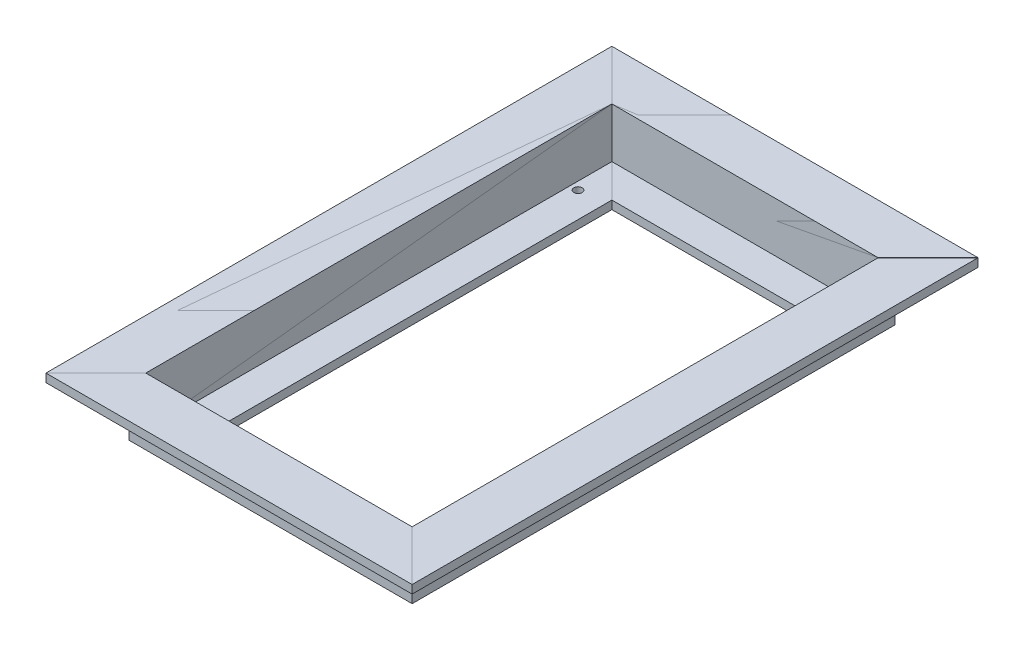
ISO-10303-21;
HEADER;
FILE_DESCRIPTION(('STEP AP214'),'2;1');
FILE_NAME('part.step','',(''),(''),'','','');
FILE_SCHEMA(('AUTOMOTIVE_DESIGN { 1 0 10303 214 1 1 1 1 }'));
ENDSEC;
DATA;
#1=APPLICATION_CONTEXT('core data for automotive mechanical design processes');
#2=APPLICATION_PROTOCOL_DEFINITION('international standard','automotive_design',2000,#1);
#3=PRODUCT_CONTEXT('',#1,'mechanical');
#4=PRODUCT('Part','Part','',(#3));
#5=PRODUCT_RELATED_PRODUCT_CATEGORY('part','',(#4));
#6=PRODUCT_DEFINITION_FORMATION('','',#4);
#7=PRODUCT_DEFINITION_CONTEXT('part definition',#1,'design');
#8=PRODUCT_DEFINITION('design','',#6,#7);
#9=PRODUCT_DEFINITION_SHAPE('','',#8);
#10=(LENGTH_UNIT() NAMED_UNIT(*) SI_UNIT(.MILLI.,.METRE.));
#11=(NAMED_UNIT(*) PLANE_ANGLE_UNIT() SI_UNIT($,.RADIAN.));
#12=(NAMED_UNIT(*) SI_UNIT($,.STERADIAN.) SOLID_ANGLE_UNIT());
#13=UNCERTAINTY_MEASURE_WITH_UNIT(LENGTH_MEASURE(1.E-05),#10,'distance_accuracy_value','');
#14=(GEOMETRIC_REPRESENTATION_CONTEXT(3) GLOBAL_UNCERTAINTY_ASSIGNED_CONTEXT((#13)) GLOBAL_UNIT_ASSIGNED_CONTEXT((#10,
#11,#12)) REPRESENTATION_CONTEXT('',''));
#15=CARTESIAN_POINT('',(0.,0.,0.));
#16=DIRECTION('',(0.,0.,1.));
#17=DIRECTION('',(1.,0.,0.));
#18=AXIS2_PLACEMENT_3D('',#15,#16,#17);
#19=CARTESIAN_POINT('',(0.,-19.0500000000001,0.));
#20=DIRECTION('',(0.,-1.,0.));
#21=DIRECTION('',(1.,0.,0.));
#22=AXIS2_PLACEMENT_3D('',#19,#20,#21);
#23=PLANE('',#22);
#24=CARTESIAN_POINT('',(22.0125880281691,-19.0500000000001,73.0250000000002));
#25=DIRECTION('',(0.,1.,0.));
#26=DIRECTION('',(-1.,0.,0.));
#27=AXIS2_PLACEMENT_3D('',#24,#25,#26);
#28=CIRCLE('',#27,1.58750000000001);
#29=CARTESIAN_POINT('',(20.4250880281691,-19.0500000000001,73.0250000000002));
#30=VERTEX_POINT('',#29);
#31=EDGE_CURVE('E214',#30,#30,#28,.T.);
#32=ORIENTED_EDGE('',*,*,#31,.F.);
#33=EDGE_LOOP('',(#32));
#34=FACE_BOUND('',#33,.T.);
#35=CARTESIAN_POINT('',(22.012588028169,-19.0500000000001,-73.0250000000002));
#36=DIRECTION('',(0.,1.,0.));
#37=DIRECTION('',(-1.,0.,0.));
#38=AXIS2_PLACEMENT_3D('',#35,#36,#37);
#39=CIRCLE('',#38,1.58749999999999);
#40=CARTESIAN_POINT('',(20.425088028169,-19.0500000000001,-73.0250000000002));
#41=VERTEX_POINT('',#40);
#42=EDGE_CURVE('E217',#41,#41,#39,.T.);
#43=ORIENTED_EDGE('',*,*,#42,.F.);
#44=EDGE_LOOP('',(#43));
#45=FACE_BOUND('',#44,.T.);
#46=DIRECTION('',(0.,0.,-1.));
#47=VECTOR('',#46,1.);
#48=CARTESIAN_POINT('',(31.7500000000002,-19.0500000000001,76.2000000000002));
#49=LINE('',#48,#47);
#50=CARTESIAN_POINT('',(31.7500000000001,-19.0500000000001,76.1640789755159));
#51=VERTEX_POINT('',#50);
#52=CARTESIAN_POINT('',(31.7500000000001,-19.0500000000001,-76.1640789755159));
#53=VERTEX_POINT('',#52);
#54=EDGE_CURVE('E135',#51,#53,#49,.T.);
#55=ORIENTED_EDGE('',*,*,#54,.T.);
#56=DIRECTION('',(-0.70710678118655,0.,-0.70710678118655));
#57=VECTOR('',#56,1.);
#58=CARTESIAN_POINT('',(53.957039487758,-19.05,-53.957039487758));
#59=LINE('',#58,#57);
#60=CARTESIAN_POINT('',(19.05,-19.05,-88.8640789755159));
#61=VERTEX_POINT('',#60);
#62=EDGE_CURVE('E63',#53,#61,#59,.T.);
#63=ORIENTED_EDGE('',*,*,#62,.T.);
#64=DIRECTION('',(0.,0.,-1.));
#65=VECTOR('',#64,1.);
#66=CARTESIAN_POINT('',(19.0500000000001,-19.05,88.9000000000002));
#67=LINE('',#66,#65);
#68=CARTESIAN_POINT('',(19.0500000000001,-19.05,88.8640789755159));
#69=VERTEX_POINT('',#68);
#70=EDGE_CURVE('E157',#69,#61,#67,.T.);
#71=ORIENTED_EDGE('',*,*,#70,.F.);
#72=DIRECTION('',(0.707106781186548,0.,-0.707106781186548));
#73=VECTOR('',#72,1.);
#74=CARTESIAN_POINT('',(53.9570394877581,-19.05,53.957039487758));
#75=LINE('',#74,#73);
#76=EDGE_CURVE('E126',#69,#51,#75,.T.);
#77=ORIENTED_EDGE('',*,*,#76,.T.);
#78=EDGE_LOOP('',(#55,#63,#71,#77));
#79=FACE_BOUND('',#78,.T.);
#80=ADVANCED_FACE('F47',(#34,#45,#79),#23,.F.);
#81=CARTESIAN_POINT('',(0.,-22.2250000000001,0.));
#82=DIRECTION('',(0.,-1.,0.));
#83=DIRECTION('',(1.,0.,0.));
#84=AXIS2_PLACEMENT_3D('',#81,#82,#83);
#85=PLANE('',#84);
#86=CARTESIAN_POINT('',(22.0125880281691,-22.2250000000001,73.0250000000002));
#87=DIRECTION('',(0.,-1.,0.));
#88=DIRECTION('',(1.,0.,0.));
#89=AXIS2_PLACEMENT_3D('',#86,#87,#88);
#90=CIRCLE('',#89,1.58750000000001);
#91=CARTESIAN_POINT('',(23.6000880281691,-22.2250000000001,73.0250000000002));
#92=VERTEX_POINT('',#91);
#93=EDGE_CURVE('E138',#92,#92,#90,.F.);
#94=ORIENTED_EDGE('',*,*,#93,.T.);
#95=EDGE_LOOP('',(#94));
#96=FACE_BOUND('',#95,.T.);
#97=CARTESIAN_POINT('',(22.012588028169,-22.2250000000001,-73.0250000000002));
#98=DIRECTION('',(0.,-1.,0.));
#99=DIRECTION('',(1.,0.,0.));
#100=AXIS2_PLACEMENT_3D('',#97,#98,#99);
#101=CIRCLE('',#100,1.58749999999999);
#102=CARTESIAN_POINT('',(23.600088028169,-22.2250000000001,-73.0250000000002));
#103=VERTEX_POINT('',#102);
#104=EDGE_CURVE('E133',#103,#103,#101,.F.);
#105=ORIENTED_EDGE('',*,*,#104,.T.);
#106=EDGE_LOOP('',(#105));
#107=FACE_BOUND('',#106,.T.);
#108=DIRECTION('',(-0.707106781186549,0.,-0.70710678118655));
#109=VECTOR('',#108,1.);
#110=CARTESIAN_POINT('',(15.875,-22.2250000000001,-92.0390789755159));
#111=LINE('',#110,#109);
#112=CARTESIAN_POINT('',(31.7500000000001,-22.2250000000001,-76.1640789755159));
#113=VERTEX_POINT('',#112);
#114=CARTESIAN_POINT('',(15.875,-22.2250000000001,-92.0390789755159));
#115=VERTEX_POINT('',#114);
#116=EDGE_CURVE('E12',#113,#115,#111,.T.);
#117=ORIENTED_EDGE('',*,*,#116,.F.);
#118=DIRECTION('',(0.,0.,-1.));
#119=VECTOR('',#118,1.);
#120=CARTESIAN_POINT('',(31.7500000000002,-22.2250000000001,76.2000000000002));
#121=LINE('',#120,#119);
#122=CARTESIAN_POINT('',(31.7500000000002,-22.2250000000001,76.1640789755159));
#123=VERTEX_POINT('',#122);
#124=EDGE_CURVE('E139',#123,#113,#121,.T.);
#125=ORIENTED_EDGE('',*,*,#124,.F.);
#126=DIRECTION('',(0.707106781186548,0.,-0.707106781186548));
#127=VECTOR('',#126,1.);
#128=CARTESIAN_POINT('',(15.8750000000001,-22.2250000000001,92.0390789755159));
#129=LINE('',#128,#127);
#130=CARTESIAN_POINT('',(15.8750000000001,-22.2250000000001,92.0390789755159));
#131=VERTEX_POINT('',#130);
#132=EDGE_CURVE('E125',#131,#123,#129,.T.);
#133=ORIENTED_EDGE('',*,*,#132,.F.);
#134=DIRECTION('',(0.,0.,-1.));
#135=VECTOR('',#134,1.);
#136=CARTESIAN_POINT('',(15.8750000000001,-22.2250000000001,92.0750000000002));
#137=LINE('',#136,#135);
#138=EDGE_CURVE('E112',#131,#115,#137,.T.);
#139=ORIENTED_EDGE('',*,*,#138,.T.);
#140=EDGE_LOOP('',(#117,#125,#133,#139));
#141=FACE_BOUND('',#140,.T.);
#142=ADVANCED_FACE('F124',(#96,#107,#141),#85,.T.);
#143=CARTESIAN_POINT('',(19.0320394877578,-19.0500250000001,-88.882039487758));
#144=DIRECTION('',(-0.707106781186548,0.,0.707106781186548));
#145=DIRECTION('',(-0.70710678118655,0.,-0.70710678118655));
#146=AXIS2_PLACEMENT_3D('',#143,#144,#145);
#147=PLANE('',#146);
#148=DIRECTION('',(0.,1.,0.));
#149=VECTOR('',#148,1.);
#150=CARTESIAN_POINT('',(15.875,-3.17499999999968,-92.0390789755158));
#151=LINE('',#150,#149);
#152=CARTESIAN_POINT('',(15.875,-3.175,-92.0390789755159));
#153=VERTEX_POINT('',#152);
#154=EDGE_CURVE('E108',#115,#153,#151,.T.);
#155=ORIENTED_EDGE('',*,*,#154,.T.);
#156=DIRECTION('',(-0.70710678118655,0.,-0.70710678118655));
#157=VECTOR('',#156,1.);
#158=CARTESIAN_POINT('',(168.257039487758,-3.17499999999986,60.3429605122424));
#159=LINE('',#158,#157);
#160=CARTESIAN_POINT('',(0.,-3.1750000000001,-107.914078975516));
#161=VERTEX_POINT('',#160);
#162=EDGE_CURVE('E141',#153,#161,#159,.T.);
#163=ORIENTED_EDGE('',*,*,#162,.T.);
#164=DIRECTION('',(0.,-1.,0.));
#165=VECTOR('',#164,1.);
#166=CARTESIAN_POINT('',(1.38777878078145E-13,-144.167881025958,-107.914078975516));
#167=LINE('',#166,#165);
#168=CARTESIAN_POINT('',(0.,-1.01770443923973E-13,-107.914078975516));
#169=VERTEX_POINT('',#168);
#170=EDGE_CURVE('E151',#169,#161,#167,.T.);
#171=ORIENTED_EDGE('',*,*,#170,.F.);
#172=DIRECTION('',(-0.707106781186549,0.,-0.707106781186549));
#173=VECTOR('',#172,1.);
#174=CARTESIAN_POINT('',(19.0320394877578,0.,-88.882039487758));
#175=LINE('',#174,#173);
#176=CARTESIAN_POINT('',(19.05,0.,-88.8640789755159));
#177=VERTEX_POINT('',#176);
#178=EDGE_CURVE('E145',#177,#169,#175,.T.);
#179=ORIENTED_EDGE('',*,*,#178,.F.);
#180=DIRECTION('',(0.,-1.,0.));
#181=VECTOR('',#180,1.);
#182=CARTESIAN_POINT('',(19.05,2.58999702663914E-13,-88.8640789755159));
#183=LINE('',#182,#181);
#184=EDGE_CURVE('E117',#177,#61,#183,.T.);
#185=ORIENTED_EDGE('',*,*,#184,.T.);
#186=ORIENTED_EDGE('',*,*,#62,.F.);
#187=DIRECTION('',(0.,-1.,0.));
#188=VECTOR('',#187,1.);
#189=CARTESIAN_POINT('',(31.7500000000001,-22.2250000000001,-76.1640789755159));
#190=LINE('',#189,#188);
#191=EDGE_CURVE('E55',#53,#113,#190,.T.);
#192=ORIENTED_EDGE('',*,*,#191,.T.);
#193=ORIENTED_EDGE('',*,*,#116,.T.);
#194=EDGE_LOOP('',(#155,#163,#171,#179,#185,#186,#192,#193));
#195=FACE_BOUND('',#194,.T.);
#196=ADVANCED_FACE('F119',(#195),#147,.F.);
#197=CARTESIAN_POINT('',(15.8750000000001,-22.2250000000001,92.0750000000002));
#198=DIRECTION('',(1.,0.,0.));
#199=DIRECTION('',(0.,1.,0.));
#200=AXIS2_PLACEMENT_3D('',#197,#198,#199);
#201=PLANE('',#200);
#202=ORIENTED_EDGE('',*,*,#154,.F.);
#203=ORIENTED_EDGE('',*,*,#138,.F.);
#204=DIRECTION('',(0.,-1.,0.));
#205=VECTOR('',#204,1.);
#206=CARTESIAN_POINT('',(15.8750000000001,-3.17499999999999,92.0390789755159));
#207=LINE('',#206,#205);
#208=CARTESIAN_POINT('',(15.8750000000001,-3.17500000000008,92.0390789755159));
#209=VERTEX_POINT('',#208);
#210=EDGE_CURVE('E142',#209,#131,#207,.T.);
#211=ORIENTED_EDGE('',*,*,#210,.F.);
#212=DIRECTION('',(0.,0.,-1.));
#213=VECTOR('',#212,1.);
#214=CARTESIAN_POINT('',(15.8750000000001,-3.175,88.9000000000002));
#215=LINE('',#214,#213);
#216=EDGE_CURVE('E114',#209,#153,#215,.T.);
#217=ORIENTED_EDGE('',*,*,#216,.T.);
#218=EDGE_LOOP('',(#202,#203,#211,#217));
#219=FACE_BOUND('',#218,.T.);
#220=ADVANCED_FACE('F109',(#219),#201,.F.);
#221=CARTESIAN_POINT('',(31.7500000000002,-22.2250000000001,76.2000000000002));
#222=DIRECTION('',(1.,0.,0.));
#223=DIRECTION('',(0.,1.,0.));
#224=AXIS2_PLACEMENT_3D('',#221,#222,#223);
#225=PLANE('',#224);
#226=ORIENTED_EDGE('',*,*,#191,.F.);
#227=ORIENTED_EDGE('',*,*,#54,.F.);
#228=DIRECTION('',(0.,1.,0.));
#229=VECTOR('',#228,1.);
#230=CARTESIAN_POINT('',(31.7500000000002,-22.2250000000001,76.1640789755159));
#231=LINE('',#230,#229);
#232=EDGE_CURVE('E170',#123,#51,#231,.T.);
#233=ORIENTED_EDGE('',*,*,#232,.F.);
#234=ORIENTED_EDGE('',*,*,#124,.T.);
#235=EDGE_LOOP('',(#226,#227,#233,#234));
#236=FACE_BOUND('',#235,.T.);
#237=ADVANCED_FACE('F195',(#236),#225,.T.);
#238=CARTESIAN_POINT('',(1.38777878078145E-13,-144.167881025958,-88.9000000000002));
#239=DIRECTION('',(-1.,0.,0.));
#240=DIRECTION('',(0.,0.,-1.));
#241=AXIS2_PLACEMENT_3D('',#238,#239,#240);
#242=PLANE('',#241);
#243=DIRECTION('',(0.,1.,0.));
#244=VECTOR('',#243,1.);
#245=CARTESIAN_POINT('',(3.05311331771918E-13,-144.167881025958,107.914078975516));
#246=LINE('',#245,#244);
#247=CARTESIAN_POINT('',(0.,-3.1750000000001,107.914078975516));
#248=VERTEX_POINT('',#247);
#249=CARTESIAN_POINT('',(0.,-1.01770443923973E-13,107.914078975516));
#250=VERTEX_POINT('',#249);
#251=EDGE_CURVE('E149',#248,#250,#246,.T.);
#252=ORIENTED_EDGE('',*,*,#251,.T.);
#253=DIRECTION('',(0.,0.,-1.));
#254=VECTOR('',#253,1.);
#255=CARTESIAN_POINT('',(0.,-1.01770443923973E-13,-88.9000000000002));
#256=LINE('',#255,#254);
#257=EDGE_CURVE('E155',#250,#169,#256,.T.);
#258=ORIENTED_EDGE('',*,*,#257,.T.);
#259=ORIENTED_EDGE('',*,*,#170,.T.);
#260=DIRECTION('',(0.,0.,1.));
#261=VECTOR('',#260,1.);
#262=CARTESIAN_POINT('',(0.,-3.17500000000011,-88.9000000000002));
#263=LINE('',#262,#261);
#264=EDGE_CURVE('E154',#161,#248,#263,.T.);
#265=ORIENTED_EDGE('',*,*,#264,.T.);
#266=EDGE_LOOP('',(#252,#258,#259,#265));
#267=FACE_BOUND('',#266,.T.);
#268=ADVANCED_FACE('F189',(#267),#242,.T.);
#269=CARTESIAN_POINT('',(19.0500000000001,0.,88.9000000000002));
#270=DIRECTION('',(-1.,0.,0.));
#271=DIRECTION('',(0.,1.,0.));
#272=AXIS2_PLACEMENT_3D('',#269,#270,#271);
#273=PLANE('',#272);
#274=ORIENTED_EDGE('',*,*,#70,.T.);
#275=ORIENTED_EDGE('',*,*,#184,.F.);
#276=DIRECTION('',(0.,0.,-1.));
#277=VECTOR('',#276,1.);
#278=CARTESIAN_POINT('',(19.0500000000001,0.,88.9000000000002));
#279=LINE('',#278,#277);
#280=CARTESIAN_POINT('',(19.0500000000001,0.,88.8640789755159));
#281=VERTEX_POINT('',#280);
#282=EDGE_CURVE('E148',#281,#177,#279,.T.);
#283=ORIENTED_EDGE('',*,*,#282,.F.);
#284=DIRECTION('',(0.,1.,0.));
#285=VECTOR('',#284,1.);
#286=CARTESIAN_POINT('',(19.0500000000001,0.,88.8640789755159));
#287=LINE('',#286,#285);
#288=EDGE_CURVE('E167',#69,#281,#287,.T.);
#289=ORIENTED_EDGE('',*,*,#288,.F.);
#290=EDGE_LOOP('',(#274,#275,#283,#289));
#291=FACE_BOUND('',#290,.T.);
#292=ADVANCED_FACE('F181',(#291),#273,.F.);
#293=CARTESIAN_POINT('',(139.7,1.01770443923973E-13,88.9000000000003));
#294=DIRECTION('',(0.,-1.,0.));
#295=DIRECTION('',(0.,0.,-1.));
#296=AXIS2_PLACEMENT_3D('',#293,#294,#295);
#297=PLANE('',#296);
#298=ORIENTED_EDGE('',*,*,#282,.T.);
#299=ORIENTED_EDGE('',*,*,#178,.T.);
#300=ORIENTED_EDGE('',*,*,#257,.F.);
#301=DIRECTION('',(0.707106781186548,0.,-0.707106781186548));
#302=VECTOR('',#301,1.);
#303=CARTESIAN_POINT('',(19.0320394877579,0.,88.882039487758));
#304=LINE('',#303,#302);
#305=EDGE_CURVE('E147',#250,#281,#304,.T.);
#306=ORIENTED_EDGE('',*,*,#305,.T.);
#307=EDGE_LOOP('',(#298,#299,#300,#306));
#308=FACE_BOUND('',#307,.T.);
#309=ADVANCED_FACE('F187',(#308),#297,.F.);
#310=CARTESIAN_POINT('',(139.7,-3.1749999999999,88.9000000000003));
#311=DIRECTION('',(0.,1.,0.));
#312=DIRECTION('',(0.,0.,1.));
#313=AXIS2_PLACEMENT_3D('',#310,#311,#312);
#314=PLANE('',#313);
#315=ORIENTED_EDGE('',*,*,#264,.F.);
#316=ORIENTED_EDGE('',*,*,#162,.F.);
#317=ORIENTED_EDGE('',*,*,#216,.F.);
#318=DIRECTION('',(0.707106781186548,0.,-0.707106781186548));
#319=VECTOR('',#318,1.);
#320=CARTESIAN_POINT('',(79.357039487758,-3.17499999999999,28.557039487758));
#321=LINE('',#320,#319);
#322=EDGE_CURVE('E144',#248,#209,#321,.T.);
#323=ORIENTED_EDGE('',*,*,#322,.F.);
#324=EDGE_LOOP('',(#315,#316,#317,#323));
#325=FACE_BOUND('',#324,.T.);
#326=ADVANCED_FACE('F238',(#325),#314,.F.);
#327=CARTESIAN_POINT('',(19.032039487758,-19.0500250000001,88.882039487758));
#328=DIRECTION('',(-0.70710678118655,0.,-0.70710678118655));
#329=DIRECTION('',(0.707106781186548,0.,-0.707106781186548));
#330=AXIS2_PLACEMENT_3D('',#327,#328,#329);
#331=PLANE('',#330);
#332=ORIENTED_EDGE('',*,*,#322,.T.);
#333=ORIENTED_EDGE('',*,*,#210,.T.);
#334=ORIENTED_EDGE('',*,*,#132,.T.);
#335=ORIENTED_EDGE('',*,*,#232,.T.);
#336=ORIENTED_EDGE('',*,*,#76,.F.);
#337=ORIENTED_EDGE('',*,*,#288,.T.);
#338=ORIENTED_EDGE('',*,*,#305,.F.);
#339=ORIENTED_EDGE('',*,*,#251,.F.);
#340=EDGE_LOOP('',(#332,#333,#334,#335,#336,#337,#338,#339));
#341=FACE_BOUND('',#340,.T.);
#342=ADVANCED_FACE('F192',(#341),#331,.F.);
#343=CARTESIAN_POINT('',(22.012588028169,-26.7151280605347,-73.0250000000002));
#344=DIRECTION('',(0.,1.,0.));
#345=DIRECTION('',(-1.,0.,0.));
#346=AXIS2_PLACEMENT_3D('',#343,#344,#345);
#347=CYLINDRICAL_SURFACE('',#346,1.58749999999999);
#348=ORIENTED_EDGE('',*,*,#42,.T.);
#349=EDGE_LOOP('',(#348));
#350=FACE_BOUND('',#349,.T.);
#351=ORIENTED_EDGE('',*,*,#104,.F.);
#352=EDGE_LOOP('',(#351));
#353=FACE_BOUND('',#352,.T.);
#354=ADVANCED_FACE('F227',(#350,#353),#347,.F.);
#355=CARTESIAN_POINT('',(22.0125880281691,-26.7151280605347,73.0250000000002));
#356=DIRECTION('',(0.,1.,0.));
#357=DIRECTION('',(-1.,0.,0.));
#358=AXIS2_PLACEMENT_3D('',#355,#356,#357);
#359=CYLINDRICAL_SURFACE('',#358,1.58750000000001);
#360=ORIENTED_EDGE('',*,*,#31,.T.);
#361=EDGE_LOOP('',(#360));
#362=FACE_BOUND('',#361,.T.);
#363=ORIENTED_EDGE('',*,*,#93,.F.);
#364=EDGE_LOOP('',(#363));
#365=FACE_BOUND('',#364,.T.);
#366=ADVANCED_FACE('F224',(#362,#365),#359,.F.);
#367=CLOSED_SHELL('',(#80,#142,#196,#220,#237,#268,#292,#309,#326,#342,#354,#366));
#368=MANIFOLD_SOLID_BREP('B2',#367);
#369=CARTESIAN_POINT('',(0.,-144.167881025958,-107.95));
#370=DIRECTION('',(0.,0.,-1.));
#371=DIRECTION('',(1.,0.,0.));
#372=AXIS2_PLACEMENT_3D('',#369,#370,#371);
#373=PLANE('',#372);
#374=DIRECTION('',(0.,1.,0.));
#375=VECTOR('',#374,1.);
#376=CARTESIAN_POINT('',(0.0359210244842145,-144.167881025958,-107.95));
#377=LINE('',#376,#375);
#378=CARTESIAN_POINT('',(0.0359210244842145,-3.175,-107.95));
#379=VERTEX_POINT('',#378);
#380=CARTESIAN_POINT('',(0.0359210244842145,0.,-107.95));
#381=VERTEX_POINT('',#380);
#382=EDGE_CURVE('E453',#379,#381,#377,.T.);
#383=ORIENTED_EDGE('',*,*,#382,.T.);
#384=DIRECTION('',(1.,0.,0.));
#385=VECTOR('',#384,1.);
#386=CARTESIAN_POINT('',(0.,0.,-107.95));
#387=LINE('',#386,#385);
#388=CARTESIAN_POINT('',(139.664078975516,0.,-107.95));
#389=VERTEX_POINT('',#388);
#390=EDGE_CURVE('E458',#381,#389,#387,.T.);
#391=ORIENTED_EDGE('',*,*,#390,.T.);
#392=DIRECTION('',(0.,-1.,0.));
#393=VECTOR('',#392,1.);
#394=CARTESIAN_POINT('',(139.664078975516,-144.167881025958,-107.95));
#395=LINE('',#394,#393);
#396=CARTESIAN_POINT('',(139.664078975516,-3.175,-107.95));
#397=VERTEX_POINT('',#396);
#398=EDGE_CURVE('E454',#389,#397,#395,.T.);
#399=ORIENTED_EDGE('',*,*,#398,.T.);
#400=DIRECTION('',(-1.,0.,0.));
#401=VECTOR('',#400,1.);
#402=CARTESIAN_POINT('',(0.,-3.17500000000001,-107.95));
#403=LINE('',#402,#401);
#404=EDGE_CURVE('E457',#397,#379,#403,.T.);
#405=ORIENTED_EDGE('',*,*,#404,.T.);
#406=EDGE_LOOP('',(#383,#391,#399,#405));
#407=FACE_BOUND('',#406,.T.);
#408=ADVANCED_FACE('F347',(#407),#373,.T.);
#409=CARTESIAN_POINT('',(0.,0.,-88.9000000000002));
#410=DIRECTION('',(0.,-1.,0.));
#411=DIRECTION('',(0.,0.,1.));
#412=AXIS2_PLACEMENT_3D('',#409,#410,#411);
#413=PLANE('',#412);
#414=DIRECTION('',(-1.,0.,0.));
#415=VECTOR('',#414,1.);
#416=CARTESIAN_POINT('',(0.,0.,-88.9000000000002));
#417=LINE('',#416,#415);
#418=CARTESIAN_POINT('',(120.614078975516,0.,-88.9000000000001));
#419=VERTEX_POINT('',#418);
#420=CARTESIAN_POINT('',(19.0859210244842,0.,-88.9000000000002));
#421=VERTEX_POINT('',#420);
#422=EDGE_CURVE('E451',#419,#421,#417,.T.);
#423=ORIENTED_EDGE('',*,*,#422,.F.);
#424=DIRECTION('',(0.707106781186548,0.,-0.707106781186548));
#425=VECTOR('',#424,1.);
#426=CARTESIAN_POINT('',(139.682039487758,0.,-107.967960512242));
#427=LINE('',#426,#425);
#428=EDGE_CURVE('E448',#419,#389,#427,.T.);
#429=ORIENTED_EDGE('',*,*,#428,.T.);
#430=ORIENTED_EDGE('',*,*,#390,.F.);
#431=DIRECTION('',(0.707106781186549,0.,0.70710678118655));
#432=VECTOR('',#431,1.);
#433=CARTESIAN_POINT('',(19.0679605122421,0.,-88.9179605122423));
#434=LINE('',#433,#432);
#435=EDGE_CURVE('E450',#381,#421,#434,.T.);
#436=ORIENTED_EDGE('',*,*,#435,.T.);
#437=EDGE_LOOP('',(#423,#429,#430,#436));
#438=FACE_BOUND('',#437,.T.);
#439=ADVANCED_FACE('F485',(#438),#413,.F.);
#440=CARTESIAN_POINT('',(19.0679605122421,-19.050025,-88.9179605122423));
#441=DIRECTION('',(0.707106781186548,0.,-0.707106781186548));
#442=DIRECTION('',(0.707106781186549,0.,0.70710678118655));
#443=AXIS2_PLACEMENT_3D('',#440,#441,#442);
#444=PLANE('',#443);
#445=DIRECTION('',(0.707106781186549,0.,0.70710678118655));
#446=VECTOR('',#445,1.);
#447=CARTESIAN_POINT('',(9.54296051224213,-3.175,-98.4429605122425));
#448=LINE('',#447,#446);
#449=CARTESIAN_POINT('',(15.9109210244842,-3.175,-92.0750000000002));
#450=VERTEX_POINT('',#449);
#451=EDGE_CURVE('E436',#379,#450,#448,.T.);
#452=ORIENTED_EDGE('',*,*,#451,.T.);
#453=DIRECTION('',(0.,-1.,0.));
#454=VECTOR('',#453,1.);
#455=CARTESIAN_POINT('',(15.9109210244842,-127.046681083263,-92.0750000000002));
#456=LINE('',#455,#454);
#457=CARTESIAN_POINT('',(15.9109210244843,-22.2250000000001,-92.0750000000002));
#458=VERTEX_POINT('',#457);
#459=EDGE_CURVE('E434',#450,#458,#456,.T.);
#460=ORIENTED_EDGE('',*,*,#459,.T.);
#461=DIRECTION('',(0.707106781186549,0.,0.707106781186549));
#462=VECTOR('',#461,1.);
#463=CARTESIAN_POINT('',(15.9109210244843,-22.2250000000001,-92.0750000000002));
#464=LINE('',#463,#462);
#465=CARTESIAN_POINT('',(31.7859210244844,-22.2250000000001,-76.2000000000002));
#466=VERTEX_POINT('',#465);
#467=EDGE_CURVE('E362',#458,#466,#464,.T.);
#468=ORIENTED_EDGE('',*,*,#467,.T.);
#469=DIRECTION('',(0.,1.,0.));
#470=VECTOR('',#469,1.);
#471=CARTESIAN_POINT('',(31.7859210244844,-22.2250000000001,-76.2000000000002));
#472=LINE('',#471,#470);
#473=CARTESIAN_POINT('',(31.7859210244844,-19.0500000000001,-76.2000000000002));
#474=VERTEX_POINT('',#473);
#475=EDGE_CURVE('E442',#466,#474,#472,.T.);
#476=ORIENTED_EDGE('',*,*,#475,.T.);
#477=DIRECTION('',(0.70710678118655,0.,0.70710678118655));
#478=VECTOR('',#477,1.);
#479=CARTESIAN_POINT('',(53.9929605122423,-19.05,-53.9929605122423));
#480=LINE('',#479,#478);
#481=CARTESIAN_POINT('',(19.0859210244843,-19.05,-88.9000000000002));
#482=VERTEX_POINT('',#481);
#483=EDGE_CURVE('E443',#482,#474,#480,.T.);
#484=ORIENTED_EDGE('',*,*,#483,.F.);
#485=DIRECTION('',(0.,-1.,0.));
#486=VECTOR('',#485,1.);
#487=CARTESIAN_POINT('',(19.0859210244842,-144.167881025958,-88.9000000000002));
#488=LINE('',#487,#486);
#489=EDGE_CURVE('E462',#421,#482,#488,.T.);
#490=ORIENTED_EDGE('',*,*,#489,.F.);
#491=ORIENTED_EDGE('',*,*,#435,.F.);
#492=ORIENTED_EDGE('',*,*,#382,.F.);
#493=EDGE_LOOP('',(#452,#460,#468,#476,#484,#490,#491,#492));
#494=FACE_BOUND('',#493,.T.);
#495=ADVANCED_FACE('F481',(#494),#444,.F.);
#496=CARTESIAN_POINT('',(0.,-144.167881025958,-88.9000000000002));
#497=DIRECTION('',(0.,0.,1.));
#498=DIRECTION('',(-1.,0.,0.));
#499=AXIS2_PLACEMENT_3D('',#496,#497,#498);
#500=PLANE('',#499);
#501=ORIENTED_EDGE('',*,*,#489,.T.);
#502=DIRECTION('',(-1.,0.,0.));
#503=VECTOR('',#502,1.);
#504=CARTESIAN_POINT('',(15.875,-19.05,-88.9000000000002));
#505=LINE('',#504,#503);
#506=CARTESIAN_POINT('',(120.614078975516,-19.05,-88.9000000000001));
#507=VERTEX_POINT('',#506);
#508=EDGE_CURVE('E417',#507,#482,#505,.T.);
#509=ORIENTED_EDGE('',*,*,#508,.F.);
#510=DIRECTION('',(0.,1.,0.));
#511=VECTOR('',#510,1.);
#512=CARTESIAN_POINT('',(120.614078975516,-144.167881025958,-88.9000000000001));
#513=LINE('',#512,#511);
#514=EDGE_CURVE('E459',#507,#419,#513,.T.);
#515=ORIENTED_EDGE('',*,*,#514,.T.);
#516=ORIENTED_EDGE('',*,*,#422,.T.);
#517=EDGE_LOOP('',(#501,#509,#515,#516));
#518=FACE_BOUND('',#517,.T.);
#519=ADVANCED_FACE('F484',(#518),#500,.T.);
#520=CARTESIAN_POINT('',(0.,-3.175,-88.9000000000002));
#521=DIRECTION('',(0.,1.,0.));
#522=DIRECTION('',(0.,0.,-1.));
#523=AXIS2_PLACEMENT_3D('',#520,#521,#522);
#524=PLANE('',#523);
#525=ORIENTED_EDGE('',*,*,#404,.F.);
#526=DIRECTION('',(0.707106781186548,0.,-0.707106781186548));
#527=VECTOR('',#526,1.);
#528=CARTESIAN_POINT('',(60.3070394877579,-3.175,-28.5929605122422));
#529=LINE('',#528,#527);
#530=CARTESIAN_POINT('',(123.789078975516,-3.175,-92.0750000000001));
#531=VERTEX_POINT('',#530);
#532=EDGE_CURVE('E446',#531,#397,#529,.T.);
#533=ORIENTED_EDGE('',*,*,#532,.F.);
#534=DIRECTION('',(-1.,0.,0.));
#535=VECTOR('',#534,1.);
#536=CARTESIAN_POINT('',(15.875,-3.175,-92.0750000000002));
#537=LINE('',#536,#535);
#538=EDGE_CURVE('E422',#531,#450,#537,.T.);
#539=ORIENTED_EDGE('',*,*,#538,.T.);
#540=ORIENTED_EDGE('',*,*,#451,.F.);
#541=EDGE_LOOP('',(#525,#533,#539,#540));
#542=FACE_BOUND('',#541,.T.);
#543=ADVANCED_FACE('F491',(#542),#524,.F.);
#544=CARTESIAN_POINT('',(139.682039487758,-19.050025,-107.967960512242));
#545=DIRECTION('',(-0.707106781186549,0.,-0.70710678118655));
#546=DIRECTION('',(0.707106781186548,0.,-0.707106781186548));
#547=AXIS2_PLACEMENT_3D('',#544,#545,#546);
#548=PLANE('',#547);
#549=DIRECTION('',(0.,1.,0.));
#550=VECTOR('',#549,1.);
#551=CARTESIAN_POINT('',(123.789078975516,-127.046681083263,-92.0750000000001));
#552=LINE('',#551,#550);
#553=CARTESIAN_POINT('',(123.789078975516,-22.2249999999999,-92.075));
#554=VERTEX_POINT('',#553);
#555=EDGE_CURVE('E416',#554,#531,#552,.T.);
#556=ORIENTED_EDGE('',*,*,#555,.T.);
#557=ORIENTED_EDGE('',*,*,#532,.T.);
#558=ORIENTED_EDGE('',*,*,#398,.F.);
#559=ORIENTED_EDGE('',*,*,#428,.F.);
#560=ORIENTED_EDGE('',*,*,#514,.F.);
#561=DIRECTION('',(0.707106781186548,0.,-0.707106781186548));
#562=VECTOR('',#561,1.);
#563=CARTESIAN_POINT('',(15.8570394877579,-19.0500000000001,15.857039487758));
#564=LINE('',#563,#562);
#565=CARTESIAN_POINT('',(107.914078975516,-19.0499999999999,-76.2000000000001));
#566=VERTEX_POINT('',#565);
#567=EDGE_CURVE('E432',#566,#507,#564,.T.);
#568=ORIENTED_EDGE('',*,*,#567,.F.);
#569=DIRECTION('',(0.,-1.,0.));
#570=VECTOR('',#569,1.);
#571=CARTESIAN_POINT('',(107.914078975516,-22.2249999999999,-76.2000000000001));
#572=LINE('',#571,#570);
#573=CARTESIAN_POINT('',(107.914078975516,-22.2249999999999,-76.2000000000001));
#574=VERTEX_POINT('',#573);
#575=EDGE_CURVE('E355',#566,#574,#572,.T.);
#576=ORIENTED_EDGE('',*,*,#575,.T.);
#577=DIRECTION('',(0.707106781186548,0.,-0.707106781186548));
#578=VECTOR('',#577,1.);
#579=CARTESIAN_POINT('',(123.789078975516,-22.2249999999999,-92.075));
#580=LINE('',#579,#578);
#581=EDGE_CURVE('E45',#574,#554,#580,.T.);
#582=ORIENTED_EDGE('',*,*,#581,.T.);
#583=EDGE_LOOP('',(#556,#557,#558,#559,#560,#568,#576,#582));
#584=FACE_BOUND('',#583,.T.);
#585=ADVANCED_FACE('F429',(#584),#548,.F.);
#586=CARTESIAN_POINT('',(31.7500000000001,-22.2250000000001,-76.2000000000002));
#587=DIRECTION('',(0.,0.,1.));
#588=DIRECTION('',(1.,0.,0.));
#589=AXIS2_PLACEMENT_3D('',#586,#587,#588);
#590=PLANE('',#589);
#591=ORIENTED_EDGE('',*,*,#475,.F.);
#592=DIRECTION('',(1.,0.,0.));
#593=VECTOR('',#592,1.);
#594=CARTESIAN_POINT('',(31.7500000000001,-22.2250000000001,-76.2000000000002));
#595=LINE('',#594,#593);
#596=EDGE_CURVE('E426',#466,#574,#595,.T.);
#597=ORIENTED_EDGE('',*,*,#596,.T.);
#598=ORIENTED_EDGE('',*,*,#575,.F.);
#599=DIRECTION('',(1.,0.,0.));
#600=VECTOR('',#599,1.);
#601=CARTESIAN_POINT('',(31.7500000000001,-19.0500000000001,-76.2000000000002));
#602=LINE('',#601,#600);
#603=EDGE_CURVE('E371',#474,#566,#602,.T.);
#604=ORIENTED_EDGE('',*,*,#603,.F.);
#605=EDGE_LOOP('',(#591,#597,#598,#604));
#606=FACE_BOUND('',#605,.T.);
#607=ADVANCED_FACE('F480',(#606),#590,.T.);
#608=CARTESIAN_POINT('',(15.875,-22.2250000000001,-92.0750000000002));
#609=DIRECTION('',(0.,0.,1.));
#610=DIRECTION('',(1.,0.,0.));
#611=AXIS2_PLACEMENT_3D('',#608,#609,#610);
#612=PLANE('',#611);
#613=DIRECTION('',(1.,0.,0.));
#614=VECTOR('',#613,1.);
#615=CARTESIAN_POINT('',(15.875,-22.2250000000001,-92.0750000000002));
#616=LINE('',#615,#614);
#617=EDGE_CURVE('E409',#458,#554,#616,.T.);
#618=ORIENTED_EDGE('',*,*,#617,.F.);
#619=ORIENTED_EDGE('',*,*,#459,.F.);
#620=ORIENTED_EDGE('',*,*,#538,.F.);
#621=ORIENTED_EDGE('',*,*,#555,.F.);
#622=EDGE_LOOP('',(#618,#619,#620,#621));
#623=FACE_BOUND('',#622,.T.);
#624=ADVANCED_FACE('F420',(#623),#612,.F.);
#625=CARTESIAN_POINT('',(0.,-22.2250000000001,0.));
#626=DIRECTION('',(0.,-1.,0.));
#627=DIRECTION('',(1.,0.,0.));
#628=AXIS2_PLACEMENT_3D('',#625,#626,#627);
#629=PLANE('',#628);
#630=ORIENTED_EDGE('',*,*,#467,.F.);
#631=ORIENTED_EDGE('',*,*,#617,.T.);
#632=ORIENTED_EDGE('',*,*,#581,.F.);
#633=ORIENTED_EDGE('',*,*,#596,.F.);
#634=EDGE_LOOP('',(#630,#631,#632,#633));
#635=FACE_BOUND('',#634,.T.);
#636=ADVANCED_FACE('F411',(#635),#629,.T.);
#637=CARTESIAN_POINT('',(0.,-19.0500000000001,0.));
#638=DIRECTION('',(0.,-1.,0.));
#639=DIRECTION('',(1.,0.,0.));
#640=AXIS2_PLACEMENT_3D('',#637,#638,#639);
#641=PLANE('',#640);
#642=ORIENTED_EDGE('',*,*,#508,.T.);
#643=ORIENTED_EDGE('',*,*,#483,.T.);
#644=ORIENTED_EDGE('',*,*,#603,.T.);
#645=ORIENTED_EDGE('',*,*,#567,.T.);
#646=EDGE_LOOP('',(#642,#643,#644,#645));
#647=FACE_BOUND('',#646,.T.);
#648=ADVANCED_FACE('F349',(#647),#641,.F.);
#649=CLOSED_SHELL('',(#408,#439,#495,#519,#543,#585,#607,#624,#636,#648));
#650=MANIFOLD_SOLID_BREP('B6',#649);
#651=CARTESIAN_POINT('',(139.7,-144.167881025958,-88.9000000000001));
#652=DIRECTION('',(1.,0.,0.));
#653=DIRECTION('',(0.,0.,-1.));
#654=AXIS2_PLACEMENT_3D('',#651,#652,#653);
#655=PLANE('',#654);
#656=DIRECTION('',(0.,1.,0.));
#657=VECTOR('',#656,1.);
#658=CARTESIAN_POINT('',(139.700000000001,-144.167881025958,107.914078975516));
#659=LINE('',#658,#657);
#660=CARTESIAN_POINT('',(139.700000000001,-3.175,107.914078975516));
#661=VERTEX_POINT('',#660);
#662=CARTESIAN_POINT('',(139.700000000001,0.,107.914078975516));
#663=VERTEX_POINT('',#662);
#664=EDGE_CURVE('E686',#661,#663,#659,.T.);
#665=ORIENTED_EDGE('',*,*,#664,.F.);
#666=DIRECTION('',(0.,0.,1.));
#667=VECTOR('',#666,1.);
#668=CARTESIAN_POINT('',(139.7,-3.17500000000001,-88.9));
#669=LINE('',#668,#667);
#670=CARTESIAN_POINT('',(139.7,-3.175,-107.914078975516));
#671=VERTEX_POINT('',#670);
#672=EDGE_CURVE('E717',#671,#661,#669,.T.);
#673=ORIENTED_EDGE('',*,*,#672,.F.);
#674=DIRECTION('',(0.,-1.,0.));
#675=VECTOR('',#674,1.);
#676=CARTESIAN_POINT('',(139.7,-144.167881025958,-107.914078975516));
#677=LINE('',#676,#675);
#678=CARTESIAN_POINT('',(139.7,0.,-107.914078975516));
#679=VERTEX_POINT('',#678);
#680=EDGE_CURVE('E701',#679,#671,#677,.T.);
#681=ORIENTED_EDGE('',*,*,#680,.F.);
#682=DIRECTION('',(0.,0.,-1.));
#683=VECTOR('',#682,1.);
#684=CARTESIAN_POINT('',(139.7,0.,-88.9));
#685=LINE('',#684,#683);
#686=EDGE_CURVE('E711',#663,#679,#685,.T.);
#687=ORIENTED_EDGE('',*,*,#686,.F.);
#688=EDGE_LOOP('',(#665,#673,#681,#687));
#689=FACE_BOUND('',#688,.T.);
#690=ADVANCED_FACE('F600',(#689),#655,.T.);
#691=CARTESIAN_POINT('',(0.,0.,88.9000000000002));
#692=DIRECTION('',(0.,-1.,0.));
#693=DIRECTION('',(0.,0.,-1.));
#694=AXIS2_PLACEMENT_3D('',#691,#692,#693);
#695=PLANE('',#694);
#696=DIRECTION('',(0.,0.,-1.));
#697=VECTOR('',#696,1.);
#698=CARTESIAN_POINT('',(120.65,0.,88.9000000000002));
#699=LINE('',#698,#697);
#700=CARTESIAN_POINT('',(120.65,0.,88.864078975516));
#701=VERTEX_POINT('',#700);
#702=CARTESIAN_POINT('',(120.65,0.,-88.8640789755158));
#703=VERTEX_POINT('',#702);
#704=EDGE_CURVE('E712',#701,#703,#699,.T.);
#705=ORIENTED_EDGE('',*,*,#704,.F.);
#706=DIRECTION('',(-0.707106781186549,0.,-0.707106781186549));
#707=VECTOR('',#706,1.);
#708=CARTESIAN_POINT('',(120.667960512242,0.,88.8820394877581));
#709=LINE('',#708,#707);
#710=EDGE_CURVE('E669',#663,#701,#709,.T.);
#711=ORIENTED_EDGE('',*,*,#710,.F.);
#712=ORIENTED_EDGE('',*,*,#686,.T.);
#713=DIRECTION('',(0.707106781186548,0.,-0.707106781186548));
#714=VECTOR('',#713,1.);
#715=CARTESIAN_POINT('',(120.667960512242,0.,-88.8820394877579));
#716=LINE('',#715,#714);
#717=EDGE_CURVE('E703',#703,#679,#716,.T.);
#718=ORIENTED_EDGE('',*,*,#717,.F.);
#719=EDGE_LOOP('',(#705,#711,#712,#718));
#720=FACE_BOUND('',#719,.T.);
#721=ADVANCED_FACE('F735',(#720),#695,.F.);
#722=CARTESIAN_POINT('',(120.667960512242,-19.050025,-88.8820394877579));
#723=DIRECTION('',(0.70710678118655,0.,0.70710678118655));
#724=DIRECTION('',(0.707106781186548,0.,-0.707106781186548));
#725=AXIS2_PLACEMENT_3D('',#722,#723,#724);
#726=PLANE('',#725);
#727=DIRECTION('',(0.707106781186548,0.,-0.707106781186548));
#728=VECTOR('',#727,1.);
#729=CARTESIAN_POINT('',(-28.5570394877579,-3.175,60.3429605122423));
#730=LINE('',#729,#728);
#731=CARTESIAN_POINT('',(123.825,-3.17499999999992,-92.0390789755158));
#732=VERTEX_POINT('',#731);
#733=EDGE_CURVE('E689',#732,#671,#730,.T.);
#734=ORIENTED_EDGE('',*,*,#733,.F.);
#735=DIRECTION('',(0.,1.,0.));
#736=VECTOR('',#735,1.);
#737=CARTESIAN_POINT('',(123.825,-3.1749999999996,-92.0390789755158));
#738=LINE('',#737,#736);
#739=CARTESIAN_POINT('',(123.825,-22.2249999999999,-92.0390789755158));
#740=VERTEX_POINT('',#739);
#741=EDGE_CURVE('E678',#740,#732,#738,.T.);
#742=ORIENTED_EDGE('',*,*,#741,.F.);
#743=DIRECTION('',(-0.707106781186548,0.,0.707106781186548));
#744=VECTOR('',#743,1.);
#745=CARTESIAN_POINT('',(123.825,-22.2249999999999,-92.0390789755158));
#746=LINE('',#745,#744);
#747=CARTESIAN_POINT('',(107.95,-22.2249999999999,-76.1640789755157));
#748=VERTEX_POINT('',#747);
#749=EDGE_CURVE('E615',#740,#748,#746,.T.);
#750=ORIENTED_EDGE('',*,*,#749,.T.);
#751=DIRECTION('',(0.,1.,0.));
#752=VECTOR('',#751,1.);
#753=CARTESIAN_POINT('',(107.95,-22.2249999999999,-76.1640789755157));
#754=LINE('',#753,#752);
#755=CARTESIAN_POINT('',(107.95,-19.0499999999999,-76.1640789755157));
#756=VERTEX_POINT('',#755);
#757=EDGE_CURVE('E695',#748,#756,#754,.T.);
#758=ORIENTED_EDGE('',*,*,#757,.T.);
#759=DIRECTION('',(-0.707106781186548,0.,0.707106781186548));
#760=VECTOR('',#759,1.);
#761=CARTESIAN_POINT('',(15.8929605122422,-19.0500000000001,15.8929605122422));
#762=LINE('',#761,#760);
#763=CARTESIAN_POINT('',(120.65,-19.05,-88.8640789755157));
#764=VERTEX_POINT('',#763);
#765=EDGE_CURVE('E697',#764,#756,#762,.T.);
#766=ORIENTED_EDGE('',*,*,#765,.F.);
#767=DIRECTION('',(0.,-1.,0.));
#768=VECTOR('',#767,1.);
#769=CARTESIAN_POINT('',(120.65,3.33014570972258E-13,-88.8640789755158));
#770=LINE('',#769,#768);
#771=EDGE_CURVE('E708',#703,#764,#770,.T.);
#772=ORIENTED_EDGE('',*,*,#771,.F.);
#773=ORIENTED_EDGE('',*,*,#717,.T.);
#774=ORIENTED_EDGE('',*,*,#680,.T.);
#775=EDGE_LOOP('',(#734,#742,#750,#758,#766,#772,#773,#774));
#776=FACE_BOUND('',#775,.T.);
#777=ADVANCED_FACE('F743',(#776),#726,.F.);
#778=CARTESIAN_POINT('',(120.65,0.,88.9000000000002));
#779=DIRECTION('',(1.,0.,0.));
#780=DIRECTION('',(0.,1.,0.));
#781=AXIS2_PLACEMENT_3D('',#778,#779,#780);
#782=PLANE('',#781);
#783=DIRECTION('',(0.,0.,-1.));
#784=VECTOR('',#783,1.);
#785=CARTESIAN_POINT('',(120.65,-19.0499999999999,88.9000000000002));
#786=LINE('',#785,#784);
#787=CARTESIAN_POINT('',(120.65,-19.05,88.864078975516));
#788=VERTEX_POINT('',#787);
#789=EDGE_CURVE('E670',#788,#764,#786,.T.);
#790=ORIENTED_EDGE('',*,*,#789,.F.);
#791=DIRECTION('',(0.,1.,0.));
#792=VECTOR('',#791,1.);
#793=CARTESIAN_POINT('',(120.65,0.,88.864078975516));
#794=LINE('',#793,#792);
#795=EDGE_CURVE('E705',#788,#701,#794,.T.);
#796=ORIENTED_EDGE('',*,*,#795,.T.);
#797=ORIENTED_EDGE('',*,*,#704,.T.);
#798=ORIENTED_EDGE('',*,*,#771,.T.);
#799=EDGE_LOOP('',(#790,#796,#797,#798));
#800=FACE_BOUND('',#799,.T.);
#801=ADVANCED_FACE('F738',(#800),#782,.F.);
#802=CARTESIAN_POINT('',(0.,-3.175,88.9000000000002));
#803=DIRECTION('',(0.,1.,0.));
#804=DIRECTION('',(0.,0.,1.));
#805=AXIS2_PLACEMENT_3D('',#802,#803,#804);
#806=PLANE('',#805);
#807=ORIENTED_EDGE('',*,*,#672,.T.);
#808=DIRECTION('',(-0.70710678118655,0.,-0.70710678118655));
#809=VECTOR('',#808,1.);
#810=CARTESIAN_POINT('',(60.3429605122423,-3.175,28.557039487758));
#811=LINE('',#810,#809);
#812=CARTESIAN_POINT('',(123.825,-3.175,92.039078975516));
#813=VERTEX_POINT('',#812);
#814=EDGE_CURVE('E714',#661,#813,#811,.T.);
#815=ORIENTED_EDGE('',*,*,#814,.T.);
#816=DIRECTION('',(0.,0.,-1.));
#817=VECTOR('',#816,1.);
#818=CARTESIAN_POINT('',(123.825,-3.17499999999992,88.9000000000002));
#819=LINE('',#818,#817);
#820=EDGE_CURVE('E675',#813,#732,#819,.T.);
#821=ORIENTED_EDGE('',*,*,#820,.T.);
#822=ORIENTED_EDGE('',*,*,#733,.T.);
#823=EDGE_LOOP('',(#807,#815,#821,#822));
#824=FACE_BOUND('',#823,.T.);
#825=ADVANCED_FACE('F725',(#824),#806,.F.);
#826=CARTESIAN_POINT('',(120.667960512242,-19.050025,88.8820394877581));
#827=DIRECTION('',(0.707106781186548,0.,-0.707106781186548));
#828=DIRECTION('',(-0.70710678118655,0.,-0.70710678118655));
#829=AXIS2_PLACEMENT_3D('',#826,#827,#828);
#830=PLANE('',#829);
#831=DIRECTION('',(0.,-1.,0.));
#832=VECTOR('',#831,1.);
#833=CARTESIAN_POINT('',(123.825,-3.17499999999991,92.039078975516));
#834=LINE('',#833,#832);
#835=CARTESIAN_POINT('',(123.825,-22.2249999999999,92.039078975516));
#836=VERTEX_POINT('',#835);
#837=EDGE_CURVE('E673',#813,#836,#834,.T.);
#838=ORIENTED_EDGE('',*,*,#837,.F.);
#839=ORIENTED_EDGE('',*,*,#814,.F.);
#840=ORIENTED_EDGE('',*,*,#664,.T.);
#841=ORIENTED_EDGE('',*,*,#710,.T.);
#842=ORIENTED_EDGE('',*,*,#795,.F.);
#843=DIRECTION('',(0.70710678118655,0.,0.70710678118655));
#844=VECTOR('',#843,1.);
#845=CARTESIAN_POINT('',(15.8929605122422,-19.0500000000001,-15.8929605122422));
#846=LINE('',#845,#844);
#847=CARTESIAN_POINT('',(107.95,-19.0499999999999,76.1640789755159));
#848=VERTEX_POINT('',#847);
#849=EDGE_CURVE('E684',#848,#788,#846,.T.);
#850=ORIENTED_EDGE('',*,*,#849,.F.);
#851=DIRECTION('',(0.,-1.,0.));
#852=VECTOR('',#851,1.);
#853=CARTESIAN_POINT('',(107.95,-22.2249999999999,76.1640789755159));
#854=LINE('',#853,#852);
#855=CARTESIAN_POINT('',(107.95,-22.2249999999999,76.1640789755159));
#856=VERTEX_POINT('',#855);
#857=EDGE_CURVE('E608',#848,#856,#854,.T.);
#858=ORIENTED_EDGE('',*,*,#857,.T.);
#859=DIRECTION('',(0.707106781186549,0.,0.707106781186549));
#860=VECTOR('',#859,1.);
#861=CARTESIAN_POINT('',(123.825,-22.2249999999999,92.039078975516));
#862=LINE('',#861,#860);
#863=EDGE_CURVE('E345',#856,#836,#862,.T.);
#864=ORIENTED_EDGE('',*,*,#863,.T.);
#865=EDGE_LOOP('',(#838,#839,#840,#841,#842,#850,#858,#864));
#866=FACE_BOUND('',#865,.T.);
#867=ADVANCED_FACE('F681',(#866),#830,.F.);
#868=CARTESIAN_POINT('',(107.95,-22.2249999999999,76.2000000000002));
#869=DIRECTION('',(-1.,0.,0.));
#870=DIRECTION('',(0.,-1.,0.));
#871=AXIS2_PLACEMENT_3D('',#868,#869,#870);
#872=PLANE('',#871);
#873=ORIENTED_EDGE('',*,*,#757,.F.);
#874=DIRECTION('',(0.,0.,1.));
#875=VECTOR('',#874,1.);
#876=CARTESIAN_POINT('',(107.95,-22.2249999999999,76.2000000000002));
#877=LINE('',#876,#875);
#878=EDGE_CURVE('E700',#748,#856,#877,.T.);
#879=ORIENTED_EDGE('',*,*,#878,.T.);
#880=ORIENTED_EDGE('',*,*,#857,.F.);
#881=DIRECTION('',(0.,0.,1.));
#882=VECTOR('',#881,1.);
#883=CARTESIAN_POINT('',(107.95,-19.0499999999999,76.2000000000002));
#884=LINE('',#883,#882);
#885=EDGE_CURVE('E624',#756,#848,#884,.T.);
#886=ORIENTED_EDGE('',*,*,#885,.F.);
#887=EDGE_LOOP('',(#873,#879,#880,#886));
#888=FACE_BOUND('',#887,.T.);
#889=ADVANCED_FACE('F758',(#888),#872,.T.);
#890=CARTESIAN_POINT('',(123.825,-22.2249999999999,92.0750000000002));
#891=DIRECTION('',(-1.,0.,0.));
#892=DIRECTION('',(0.,-1.,0.));
#893=AXIS2_PLACEMENT_3D('',#890,#891,#892);
#894=PLANE('',#893);
#895=DIRECTION('',(0.,0.,1.));
#896=VECTOR('',#895,1.);
#897=CARTESIAN_POINT('',(123.825,-22.2249999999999,92.0750000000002));
#898=LINE('',#897,#896);
#899=EDGE_CURVE('E662',#740,#836,#898,.T.);
#900=ORIENTED_EDGE('',*,*,#899,.F.);
#901=ORIENTED_EDGE('',*,*,#741,.T.);
#902=ORIENTED_EDGE('',*,*,#820,.F.);
#903=ORIENTED_EDGE('',*,*,#837,.T.);
#904=EDGE_LOOP('',(#900,#901,#902,#903));
#905=FACE_BOUND('',#904,.T.);
#906=ADVANCED_FACE('F674',(#905),#894,.F.);
#907=CARTESIAN_POINT('',(0.,-22.2250000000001,0.));
#908=DIRECTION('',(0.,-1.,0.));
#909=DIRECTION('',(1.,0.,0.));
#910=AXIS2_PLACEMENT_3D('',#907,#908,#909);
#911=PLANE('',#910);
#912=CARTESIAN_POINT('',(117.687411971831,-22.2249999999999,73.0250000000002));
#913=DIRECTION('',(0.,-1.,0.));
#914=DIRECTION('',(1.,0.,0.));
#915=AXIS2_PLACEMENT_3D('',#912,#913,#914);
#916=CIRCLE('',#915,1.5875);
#917=CARTESIAN_POINT('',(119.274911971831,-22.2249999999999,73.0250000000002));
#918=VERTEX_POINT('',#917);
#919=EDGE_CURVE('E771',#918,#918,#916,.F.);
#920=ORIENTED_EDGE('',*,*,#919,.T.);
#921=EDGE_LOOP('',(#920));
#922=FACE_BOUND('',#921,.T.);
#923=CARTESIAN_POINT('',(117.687411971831,-22.2249999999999,-73.0250000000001));
#924=DIRECTION('',(0.,-1.,0.));
#925=DIRECTION('',(1.,0.,0.));
#926=AXIS2_PLACEMENT_3D('',#923,#924,#925);
#927=CIRCLE('',#926,1.58750000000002);
#928=CARTESIAN_POINT('',(119.274911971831,-22.2249999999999,-73.0250000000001));
#929=VERTEX_POINT('',#928);
#930=EDGE_CURVE('E774',#929,#929,#927,.F.);
#931=ORIENTED_EDGE('',*,*,#930,.T.);
#932=EDGE_LOOP('',(#931));
#933=FACE_BOUND('',#932,.T.);
#934=ORIENTED_EDGE('',*,*,#749,.F.);
#935=ORIENTED_EDGE('',*,*,#899,.T.);
#936=ORIENTED_EDGE('',*,*,#863,.F.);
#937=ORIENTED_EDGE('',*,*,#878,.F.);
#938=EDGE_LOOP('',(#934,#935,#936,#937));
#939=FACE_BOUND('',#938,.T.);
#940=ADVANCED_FACE('F664',(#922,#933,#939),#911,.T.);
#941=CARTESIAN_POINT('',(0.,-19.0500000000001,0.));
#942=DIRECTION('',(0.,-1.,0.));
#943=DIRECTION('',(1.,0.,0.));
#944=AXIS2_PLACEMENT_3D('',#941,#942,#943);
#945=PLANE('',#944);
#946=CARTESIAN_POINT('',(117.687411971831,-19.0499999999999,73.0250000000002));
#947=DIRECTION('',(0.,1.,0.));
#948=DIRECTION('',(-1.,0.,0.));
#949=AXIS2_PLACEMENT_3D('',#946,#947,#948);
#950=CIRCLE('',#949,1.5875);
#951=CARTESIAN_POINT('',(116.099911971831,-19.0499999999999,73.0250000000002));
#952=VERTEX_POINT('',#951);
#953=EDGE_CURVE('E776',#952,#952,#950,.T.);
#954=ORIENTED_EDGE('',*,*,#953,.F.);
#955=EDGE_LOOP('',(#954));
#956=FACE_BOUND('',#955,.T.);
#957=CARTESIAN_POINT('',(117.687411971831,-19.0499999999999,-73.0250000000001));
#958=DIRECTION('',(0.,1.,0.));
#959=DIRECTION('',(-1.,0.,0.));
#960=AXIS2_PLACEMENT_3D('',#957,#958,#959);
#961=CIRCLE('',#960,1.58750000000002);
#962=CARTESIAN_POINT('',(116.099911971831,-19.0499999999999,-73.0250000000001));
#963=VERTEX_POINT('',#962);
#964=EDGE_CURVE('E777',#963,#963,#961,.T.);
#965=ORIENTED_EDGE('',*,*,#964,.F.);
#966=EDGE_LOOP('',(#965));
#967=FACE_BOUND('',#966,.T.);
#968=ORIENTED_EDGE('',*,*,#789,.T.);
#969=ORIENTED_EDGE('',*,*,#765,.T.);
#970=ORIENTED_EDGE('',*,*,#885,.T.);
#971=ORIENTED_EDGE('',*,*,#849,.T.);
#972=EDGE_LOOP('',(#968,#969,#970,#971));
#973=FACE_BOUND('',#972,.T.);
#974=ADVANCED_FACE('F602',(#956,#967,#973),#945,.F.);
#975=CARTESIAN_POINT('',(117.687411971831,-26.7151280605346,-73.0250000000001));
#976=DIRECTION('',(0.,1.,0.));
#977=DIRECTION('',(-1.,0.,0.));
#978=AXIS2_PLACEMENT_3D('',#975,#976,#977);
#979=CYLINDRICAL_SURFACE('',#978,1.58750000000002);
#980=ORIENTED_EDGE('',*,*,#964,.T.);
#981=EDGE_LOOP('',(#980));
#982=FACE_BOUND('',#981,.T.);
#983=ORIENTED_EDGE('',*,*,#930,.F.);
#984=EDGE_LOOP('',(#983));
#985=FACE_BOUND('',#984,.T.);
#986=ADVANCED_FACE('F765',(#982,#985),#979,.F.);
#987=CARTESIAN_POINT('',(117.687411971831,-26.7151280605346,73.0250000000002));
#988=DIRECTION('',(0.,1.,0.));
#989=DIRECTION('',(-1.,0.,0.));
#990=AXIS2_PLACEMENT_3D('',#987,#988,#989);
#991=CYLINDRICAL_SURFACE('',#990,1.5875);
#992=ORIENTED_EDGE('',*,*,#953,.T.);
#993=EDGE_LOOP('',(#992));
#994=FACE_BOUND('',#993,.T.);
#995=ORIENTED_EDGE('',*,*,#919,.F.);
#996=EDGE_LOOP('',(#995));
#997=FACE_BOUND('',#996,.T.);
#998=ADVANCED_FACE('F790',(#994,#997),#991,.F.);
#999=CLOSED_SHELL('',(#690,#721,#777,#801,#825,#867,#889,#906,#940,#974,#986,#998));
#1000=MANIFOLD_SOLID_BREP('B39',#999);
#1001=CARTESIAN_POINT('',(0.,-3.175,88.9));
#1002=DIRECTION('',(0.,1.,0.));
#1003=DIRECTION('',(0.,0.,1.));
#1004=AXIS2_PLACEMENT_3D('',#1001,#1002,#1003);
#1005=PLANE('',#1004);
#1006=DIRECTION('',(0.,0.,-1.));
#1007=VECTOR('',#1006,1.);
#1008=CARTESIAN_POINT('',(15.875,-3.175,88.9));
#1009=LINE('',#1008,#1007);
#1010=CARTESIAN_POINT('',(15.875,-3.175,92.0390789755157));
#1011=VERTEX_POINT('',#1010);
#1012=CARTESIAN_POINT('',(15.875,-3.175,-92.0390789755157));
#1013=VERTEX_POINT('',#1012);
#1014=EDGE_CURVE('E988',#1011,#1013,#1009,.T.);
#1015=ORIENTED_EDGE('',*,*,#1014,.F.);
#1016=DIRECTION('',(-0.707106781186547,0.,0.707106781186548));
#1017=VECTOR('',#1016,1.);
#1018=CARTESIAN_POINT('',(9.50703948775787,-3.175,98.4070394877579));
#1019=LINE('',#1018,#1017);
#1020=CARTESIAN_POINT('',(0.,-3.175,107.914078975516));
#1021=VERTEX_POINT('',#1020);
#1022=EDGE_CURVE('E985',#1011,#1021,#1019,.T.);
#1023=ORIENTED_EDGE('',*,*,#1022,.T.);
#1024=DIRECTION('',(0.,0.,-1.));
#1025=VECTOR('',#1024,1.);
#1026=CARTESIAN_POINT('',(0.,-3.175,88.9));
#1027=LINE('',#1026,#1025);
#1028=CARTESIAN_POINT('',(0.,-3.175,-107.914078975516));
#1029=VERTEX_POINT('',#1028);
#1030=EDGE_CURVE('E987',#1021,#1029,#1027,.T.);
#1031=ORIENTED_EDGE('',*,*,#1030,.T.);
#1032=DIRECTION('',(0.707106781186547,0.,0.707106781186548));
#1033=VECTOR('',#1032,1.);
#1034=CARTESIAN_POINT('',(98.4070394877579,-3.175,-9.5070394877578));
#1035=LINE('',#1034,#1033);
#1036=EDGE_CURVE('E990',#1029,#1013,#1035,.T.);
#1037=ORIENTED_EDGE('',*,*,#1036,.T.);
#1038=EDGE_LOOP('',(#1015,#1023,#1031,#1037));
#1039=FACE_BOUND('',#1038,.T.);
#1040=ADVANCED_FACE('F900',(#1039),#1005,.F.);
#1041=CARTESIAN_POINT('',(15.875,-19.05,88.9));
#1042=DIRECTION('',(0.,1.,0.));
#1043=DIRECTION('',(0.,0.,1.));
#1044=AXIS2_PLACEMENT_3D('',#1041,#1042,#1043);
#1045=PLANE('',#1044);
#1046=DIRECTION('',(0.,0.,-1.));
#1047=VECTOR('',#1046,1.);
#1048=CARTESIAN_POINT('',(19.05,-19.05,88.9));
#1049=LINE('',#1048,#1047);
#1050=CARTESIAN_POINT('',(19.05,-19.05,88.8640789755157));
#1051=VERTEX_POINT('',#1050);
#1052=CARTESIAN_POINT('',(19.05,-19.05,-88.8640789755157));
#1053=VERTEX_POINT('',#1052);
#1054=EDGE_CURVE('E951',#1051,#1053,#1049,.T.);
#1055=ORIENTED_EDGE('',*,*,#1054,.F.);
#1056=DIRECTION('',(-0.707106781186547,0.,0.707106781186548));
#1057=VECTOR('',#1056,1.);
#1058=CARTESIAN_POINT('',(17.4445394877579,-19.05,90.4695394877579));
#1059=LINE('',#1058,#1057);
#1060=CARTESIAN_POINT('',(15.875,-19.05,92.0390789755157));
#1061=VERTEX_POINT('',#1060);
#1062=EDGE_CURVE('E933',#1051,#1061,#1059,.T.);
#1063=ORIENTED_EDGE('',*,*,#1062,.T.);
#1064=DIRECTION('',(0.,0.,-1.));
#1065=VECTOR('',#1064,1.);
#1066=CARTESIAN_POINT('',(15.875,-19.05,88.9));
#1067=LINE('',#1066,#1065);
#1068=CARTESIAN_POINT('',(15.875,-19.05,-92.0390789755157));
#1069=VERTEX_POINT('',#1068);
#1070=EDGE_CURVE('E972',#1061,#1069,#1067,.T.);
#1071=ORIENTED_EDGE('',*,*,#1070,.T.);
#1072=DIRECTION('',(0.707106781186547,0.,0.707106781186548));
#1073=VECTOR('',#1072,1.);
#1074=CARTESIAN_POINT('',(106.344539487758,-19.05,-1.56953948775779));
#1075=LINE('',#1074,#1073);
#1076=EDGE_CURVE('E965',#1069,#1053,#1075,.T.);
#1077=ORIENTED_EDGE('',*,*,#1076,.T.);
#1078=EDGE_LOOP('',(#1055,#1063,#1071,#1077));
#1079=FACE_BOUND('',#1078,.T.);
#1080=ADVANCED_FACE('F970',(#1079),#1045,.F.);
#1081=CARTESIAN_POINT('',(0.,0.,88.9));
#1082=DIRECTION('',(0.,-1.,0.));
#1083=DIRECTION('',(0.,0.,-1.));
#1084=AXIS2_PLACEMENT_3D('',#1081,#1082,#1083);
#1085=PLANE('',#1084);
#1086=DIRECTION('',(0.,0.,-1.));
#1087=VECTOR('',#1086,1.);
#1088=CARTESIAN_POINT('',(0.,0.,88.9));
#1089=LINE('',#1088,#1087);
#1090=CARTESIAN_POINT('',(0.,0.,107.914078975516));
#1091=VERTEX_POINT('',#1090);
#1092=CARTESIAN_POINT('',(0.,0.,-107.914078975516));
#1093=VERTEX_POINT('',#1092);
#1094=EDGE_CURVE('E984',#1091,#1093,#1089,.T.);
#1095=ORIENTED_EDGE('',*,*,#1094,.F.);
#1096=DIRECTION('',(-0.707106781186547,0.,0.707106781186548));
#1097=VECTOR('',#1096,1.);
#1098=CARTESIAN_POINT('',(19.0320394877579,0.,88.8820394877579));
#1099=LINE('',#1098,#1097);
#1100=CARTESIAN_POINT('',(19.05,0.,88.8640789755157));
#1101=VERTEX_POINT('',#1100);
#1102=EDGE_CURVE('E598',#1101,#1091,#1099,.T.);
#1103=ORIENTED_EDGE('',*,*,#1102,.F.);
#1104=DIRECTION('',(0.,0.,-1.));
#1105=VECTOR('',#1104,1.);
#1106=CARTESIAN_POINT('',(19.05,0.,88.9));
#1107=LINE('',#1106,#1105);
#1108=CARTESIAN_POINT('',(19.05,0.,-88.8640789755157));
#1109=VERTEX_POINT('',#1108);
#1110=EDGE_CURVE('E973',#1101,#1109,#1107,.T.);
#1111=ORIENTED_EDGE('',*,*,#1110,.T.);
#1112=DIRECTION('',(0.707106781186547,0.,0.707106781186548));
#1113=VECTOR('',#1112,1.);
#1114=CARTESIAN_POINT('',(19.0320394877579,0.,-88.8820394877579));
#1115=LINE('',#1114,#1113);
#1116=EDGE_CURVE('E908',#1093,#1109,#1115,.T.);
#1117=ORIENTED_EDGE('',*,*,#1116,.F.);
#1118=EDGE_LOOP('',(#1095,#1103,#1111,#1117));
#1119=FACE_BOUND('',#1118,.T.);
#1120=ADVANCED_FACE('F1013',(#1119),#1085,.F.);
#1121=CARTESIAN_POINT('',(0.,0.,88.9));
#1122=DIRECTION('',(1.,0.,0.));
#1123=DIRECTION('',(0.,0.,-1.));
#1124=AXIS2_PLACEMENT_3D('',#1121,#1122,#1123);
#1125=PLANE('',#1124);
#1126=ORIENTED_EDGE('',*,*,#1030,.F.);
#1127=DIRECTION('',(0.,1.,0.));
#1128=VECTOR('',#1127,1.);
#1129=CARTESIAN_POINT('',(0.,0.,107.914078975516));
#1130=LINE('',#1129,#1128);
#1131=EDGE_CURVE('E915',#1021,#1091,#1130,.T.);
#1132=ORIENTED_EDGE('',*,*,#1131,.T.);
#1133=ORIENTED_EDGE('',*,*,#1094,.T.);
#1134=DIRECTION('',(0.,-1.,0.));
#1135=VECTOR('',#1134,1.);
#1136=CARTESIAN_POINT('',(0.,0.,-107.914078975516));
#1137=LINE('',#1136,#1135);
#1138=EDGE_CURVE('E989',#1093,#1029,#1137,.T.);
#1139=ORIENTED_EDGE('',*,*,#1138,.T.);
#1140=EDGE_LOOP('',(#1126,#1132,#1133,#1139));
#1141=FACE_BOUND('',#1140,.T.);
#1142=ADVANCED_FACE('F1009',(#1141),#1125,.F.);
#1143=CARTESIAN_POINT('',(15.875,-3.175,88.9));
#1144=DIRECTION('',(1.,0.,0.));
#1145=DIRECTION('',(0.,0.,-1.));
#1146=AXIS2_PLACEMENT_3D('',#1143,#1144,#1145);
#1147=PLANE('',#1146);
#1148=ORIENTED_EDGE('',*,*,#1070,.F.);
#1149=DIRECTION('',(0.,1.,0.));
#1150=VECTOR('',#1149,1.);
#1151=CARTESIAN_POINT('',(15.875,-3.175,92.0390789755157));
#1152=LINE('',#1151,#1150);
#1153=EDGE_CURVE('E929',#1061,#1011,#1152,.T.);
#1154=ORIENTED_EDGE('',*,*,#1153,.T.);
#1155=ORIENTED_EDGE('',*,*,#1014,.T.);
#1156=DIRECTION('',(0.,-1.,0.));
#1157=VECTOR('',#1156,1.);
#1158=CARTESIAN_POINT('',(15.875,-3.175,-92.0390789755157));
#1159=LINE('',#1158,#1157);
#1160=EDGE_CURVE('E979',#1013,#1069,#1159,.T.);
#1161=ORIENTED_EDGE('',*,*,#1160,.T.);
#1162=EDGE_LOOP('',(#1148,#1154,#1155,#1161));
#1163=FACE_BOUND('',#1162,.T.);
#1164=ADVANCED_FACE('F1006',(#1163),#1147,.F.);
#1165=CARTESIAN_POINT('',(19.05,0.,88.9));
#1166=DIRECTION('',(-1.,0.,0.));
#1167=DIRECTION('',(0.,0.,1.));
#1168=AXIS2_PLACEMENT_3D('',#1165,#1166,#1167);
#1169=PLANE('',#1168);
#1170=ORIENTED_EDGE('',*,*,#1110,.F.);
#1171=DIRECTION('',(0.,-1.,0.));
#1172=VECTOR('',#1171,1.);
#1173=CARTESIAN_POINT('',(19.05,0.,88.8640789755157));
#1174=LINE('',#1173,#1172);
#1175=EDGE_CURVE('E956',#1101,#1051,#1174,.T.);
#1176=ORIENTED_EDGE('',*,*,#1175,.T.);
#1177=ORIENTED_EDGE('',*,*,#1054,.T.);
#1178=DIRECTION('',(0.,1.,0.));
#1179=VECTOR('',#1178,1.);
#1180=CARTESIAN_POINT('',(19.05,0.,-88.8640789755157));
#1181=LINE('',#1180,#1179);
#1182=EDGE_CURVE('E955',#1053,#1109,#1181,.T.);
#1183=ORIENTED_EDGE('',*,*,#1182,.T.);
#1184=EDGE_LOOP('',(#1170,#1176,#1177,#1183));
#1185=FACE_BOUND('',#1184,.T.);
#1186=ADVANCED_FACE('F954',(#1185),#1169,.F.);
#1187=CARTESIAN_POINT('',(19.0320394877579,-19.050025,-88.8820394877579));
#1188=DIRECTION('',(-0.707106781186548,0.,0.707106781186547));
#1189=DIRECTION('',(0.707106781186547,0.,0.707106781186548));
#1190=AXIS2_PLACEMENT_3D('',#1187,#1188,#1189);
#1191=PLANE('',#1190);
#1192=ORIENTED_EDGE('',*,*,#1116,.T.);
#1193=ORIENTED_EDGE('',*,*,#1182,.F.);
#1194=ORIENTED_EDGE('',*,*,#1076,.F.);
#1195=ORIENTED_EDGE('',*,*,#1160,.F.);
#1196=ORIENTED_EDGE('',*,*,#1036,.F.);
#1197=ORIENTED_EDGE('',*,*,#1138,.F.);
#1198=EDGE_LOOP('',(#1192,#1193,#1194,#1195,#1196,#1197));
#1199=FACE_BOUND('',#1198,.T.);
#1200=ADVANCED_FACE('F963',(#1199),#1191,.F.);
#1201=CARTESIAN_POINT('',(19.0320394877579,-19.050025,88.8820394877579));
#1202=DIRECTION('',(-0.707106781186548,0.,-0.707106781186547));
#1203=DIRECTION('',(-0.707106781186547,0.,0.707106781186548));
#1204=AXIS2_PLACEMENT_3D('',#1201,#1202,#1203);
#1205=PLANE('',#1204);
#1206=ORIENTED_EDGE('',*,*,#1022,.F.);
#1207=ORIENTED_EDGE('',*,*,#1153,.F.);
#1208=ORIENTED_EDGE('',*,*,#1062,.F.);
#1209=ORIENTED_EDGE('',*,*,#1175,.F.);
#1210=ORIENTED_EDGE('',*,*,#1102,.T.);
#1211=ORIENTED_EDGE('',*,*,#1131,.F.);
#1212=EDGE_LOOP('',(#1206,#1207,#1208,#1209,#1210,#1211));
#1213=FACE_BOUND('',#1212,.T.);
#1214=ADVANCED_FACE('F1014',(#1213),#1205,.F.);
#1215=CLOSED_SHELL('',(#1040,#1080,#1120,#1142,#1164,#1186,#1200,#1214));
#1216=MANIFOLD_SOLID_BREP('B339_NOT_SHOWN',#1215);
#1217=CARTESIAN_POINT('',(0.,-144.167881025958,107.95));
#1218=DIRECTION('',(0.,0.,1.));
#1219=DIRECTION('',(1.,0.,0.));
#1220=AXIS2_PLACEMENT_3D('',#1217,#1218,#1219);
#1221=PLANE('',#1220);
#1222=DIRECTION('',(0.,1.,0.));
#1223=VECTOR('',#1222,1.);
#1224=CARTESIAN_POINT('',(0.0359210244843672,-144.167881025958,107.95));
#1225=LINE('',#1224,#1223);
#1226=CARTESIAN_POINT('',(0.0359210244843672,-3.175,107.95));
#1227=VERTEX_POINT('',#1226);
#1228=CARTESIAN_POINT('',(0.0359210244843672,0.,107.95));
#1229=VERTEX_POINT('',#1228);
#1230=EDGE_CURVE('E1228',#1227,#1229,#1225,.T.);
#1231=ORIENTED_EDGE('',*,*,#1230,.F.);
#1232=DIRECTION('',(-1.,0.,0.));
#1233=VECTOR('',#1232,1.);
#1234=CARTESIAN_POINT('',(0.,-3.17500000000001,107.95));
#1235=LINE('',#1234,#1233);
#1236=CARTESIAN_POINT('',(139.664078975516,-3.175,107.95));
#1237=VERTEX_POINT('',#1236);
#1238=EDGE_CURVE('E1241',#1237,#1227,#1235,.T.);
#1239=ORIENTED_EDGE('',*,*,#1238,.F.);
#1240=DIRECTION('',(0.,-1.,0.));
#1241=VECTOR('',#1240,1.);
#1242=CARTESIAN_POINT('',(139.664078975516,-144.167881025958,107.95));
#1243=LINE('',#1242,#1241);
#1244=CARTESIAN_POINT('',(139.664078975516,0.,107.95));
#1245=VERTEX_POINT('',#1244);
#1246=EDGE_CURVE('E1248',#1245,#1237,#1243,.T.);
#1247=ORIENTED_EDGE('',*,*,#1246,.F.);
#1248=DIRECTION('',(1.,0.,0.));
#1249=VECTOR('',#1248,1.);
#1250=CARTESIAN_POINT('',(0.,0.,107.95));
#1251=LINE('',#1250,#1249);
#1252=EDGE_CURVE('E1238',#1229,#1245,#1251,.T.);
#1253=ORIENTED_EDGE('',*,*,#1252,.F.);
#1254=EDGE_LOOP('',(#1231,#1239,#1247,#1253));
#1255=FACE_BOUND('',#1254,.T.);
#1256=ADVANCED_FACE('F1133',(#1255),#1221,.T.);
#1257=CARTESIAN_POINT('',(0.,0.,88.9000000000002));
#1258=DIRECTION('',(0.,-1.,0.));
#1259=DIRECTION('',(0.,0.,-1.));
#1260=AXIS2_PLACEMENT_3D('',#1257,#1258,#1259);
#1261=PLANE('',#1260);
#1262=DIRECTION('',(-1.,0.,0.));
#1263=VECTOR('',#1262,1.);
#1264=CARTESIAN_POINT('',(0.,0.,88.9000000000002));
#1265=LINE('',#1264,#1263);
#1266=CARTESIAN_POINT('',(120.614078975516,0.,88.9000000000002));
#1267=VERTEX_POINT('',#1266);
#1268=CARTESIAN_POINT('',(19.0859210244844,0.,88.9000000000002));
#1269=VERTEX_POINT('',#1268);
#1270=EDGE_CURVE('E1235',#1267,#1269,#1265,.T.);
#1271=ORIENTED_EDGE('',*,*,#1270,.T.);
#1272=DIRECTION('',(0.707106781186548,0.,-0.707106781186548));
#1273=VECTOR('',#1272,1.);
#1274=CARTESIAN_POINT('',(19.0679605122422,0.,88.9179605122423));
#1275=LINE('',#1274,#1273);
#1276=EDGE_CURVE('E1219',#1229,#1269,#1275,.T.);
#1277=ORIENTED_EDGE('',*,*,#1276,.F.);
#1278=ORIENTED_EDGE('',*,*,#1252,.T.);
#1279=DIRECTION('',(0.70710678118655,0.,0.707106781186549));
#1280=VECTOR('',#1279,1.);
#1281=CARTESIAN_POINT('',(139.682039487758,0.,107.967960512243));
#1282=LINE('',#1281,#1280);
#1283=EDGE_CURVE('E1247',#1267,#1245,#1282,.T.);
#1284=ORIENTED_EDGE('',*,*,#1283,.F.);
#1285=EDGE_LOOP('',(#1271,#1277,#1278,#1284));
#1286=FACE_BOUND('',#1285,.T.);
#1287=ADVANCED_FACE('F1279',(#1286),#1261,.F.);
#1288=CARTESIAN_POINT('',(139.682039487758,-19.050025,107.967960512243));
#1289=DIRECTION('',(-0.707106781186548,0.,0.707106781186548));
#1290=DIRECTION('',(0.70710678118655,0.,0.707106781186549));
#1291=AXIS2_PLACEMENT_3D('',#1288,#1289,#1290);
#1292=PLANE('',#1291);
#1293=DIRECTION('',(0.70710678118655,0.,0.707106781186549));
#1294=VECTOR('',#1293,1.);
#1295=CARTESIAN_POINT('',(60.307039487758,-3.175,28.5929605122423));
#1296=LINE('',#1295,#1294);
#1297=CARTESIAN_POINT('',(123.789078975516,-3.175,92.0750000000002));
#1298=VERTEX_POINT('',#1297);
#1299=EDGE_CURVE('E1199',#1298,#1237,#1296,.T.);
#1300=ORIENTED_EDGE('',*,*,#1299,.F.);
#1301=DIRECTION('',(0.,1.,0.));
#1302=VECTOR('',#1301,1.);
#1303=CARTESIAN_POINT('',(123.789078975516,-127.046681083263,92.0750000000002));
#1304=LINE('',#1303,#1302);
#1305=CARTESIAN_POINT('',(123.789078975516,-22.2249999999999,92.0750000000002));
#1306=VERTEX_POINT('',#1305);
#1307=EDGE_CURVE('E1196',#1306,#1298,#1304,.T.);
#1308=ORIENTED_EDGE('',*,*,#1307,.F.);
#1309=DIRECTION('',(-0.707106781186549,0.,-0.707106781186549));
#1310=VECTOR('',#1309,1.);
#1311=CARTESIAN_POINT('',(123.789078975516,-22.2249999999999,92.0750000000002));
#1312=LINE('',#1311,#1310);
#1313=CARTESIAN_POINT('',(107.914078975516,-22.2249999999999,76.2000000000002));
#1314=VERTEX_POINT('',#1313);
#1315=EDGE_CURVE('E1147',#1306,#1314,#1312,.T.);
#1316=ORIENTED_EDGE('',*,*,#1315,.T.);
#1317=DIRECTION('',(0.,1.,0.));
#1318=VECTOR('',#1317,1.);
#1319=CARTESIAN_POINT('',(107.914078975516,-22.2249999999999,76.2000000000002));
#1320=LINE('',#1319,#1318);
#1321=CARTESIAN_POINT('',(107.914078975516,-19.0499999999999,76.2000000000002));
#1322=VERTEX_POINT('',#1321);
#1323=EDGE_CURVE('E898',#1314,#1322,#1320,.T.);
#1324=ORIENTED_EDGE('',*,*,#1323,.T.);
#1325=DIRECTION('',(-0.70710678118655,0.,-0.70710678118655));
#1326=VECTOR('',#1325,1.);
#1327=CARTESIAN_POINT('',(15.8570394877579,-19.0500000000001,-15.8570394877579));
#1328=LINE('',#1327,#1326);
#1329=CARTESIAN_POINT('',(120.614078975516,-19.05,88.9000000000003));
#1330=VERTEX_POINT('',#1329);
#1331=EDGE_CURVE('E1214',#1330,#1322,#1328,.T.);
#1332=ORIENTED_EDGE('',*,*,#1331,.F.);
#1333=DIRECTION('',(0.,1.,0.));
#1334=VECTOR('',#1333,1.);
#1335=CARTESIAN_POINT('',(120.614078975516,-144.167881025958,88.9000000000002));
#1336=LINE('',#1335,#1334);
#1337=EDGE_CURVE('E1237',#1330,#1267,#1336,.T.);
#1338=ORIENTED_EDGE('',*,*,#1337,.T.);
#1339=ORIENTED_EDGE('',*,*,#1283,.T.);
#1340=ORIENTED_EDGE('',*,*,#1246,.T.);
#1341=EDGE_LOOP('',(#1300,#1308,#1316,#1324,#1332,#1338,#1339,#1340));
#1342=FACE_BOUND('',#1341,.T.);
#1343=ADVANCED_FACE('F1197',(#1342),#1292,.F.);
#1344=CARTESIAN_POINT('',(0.,-144.167881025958,88.9000000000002));
#1345=DIRECTION('',(0.,0.,-1.));
#1346=DIRECTION('',(-1.,0.,0.));
#1347=AXIS2_PLACEMENT_3D('',#1344,#1345,#1346);
#1348=PLANE('',#1347);
#1349=DIRECTION('',(0.,-1.,0.));
#1350=VECTOR('',#1349,1.);
#1351=CARTESIAN_POINT('',(19.0859210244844,-144.167881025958,88.9000000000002));
#1352=LINE('',#1351,#1350);
#1353=CARTESIAN_POINT('',(19.0859210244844,-19.0500000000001,88.9000000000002));
#1354=VERTEX_POINT('',#1353);
#1355=EDGE_CURVE('E1230',#1269,#1354,#1352,.T.);
#1356=ORIENTED_EDGE('',*,*,#1355,.F.);
#1357=ORIENTED_EDGE('',*,*,#1270,.F.);
#1358=ORIENTED_EDGE('',*,*,#1337,.F.);
#1359=DIRECTION('',(-1.,0.,0.));
#1360=VECTOR('',#1359,1.);
#1361=CARTESIAN_POINT('',(15.8750000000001,-19.05,88.9000000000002));
#1362=LINE('',#1361,#1360);
#1363=EDGE_CURVE('E1205',#1330,#1354,#1362,.T.);
#1364=ORIENTED_EDGE('',*,*,#1363,.T.);
#1365=EDGE_LOOP('',(#1356,#1357,#1358,#1364));
#1366=FACE_BOUND('',#1365,.T.);
#1367=ADVANCED_FACE('F1289',(#1366),#1348,.T.);
#1368=CARTESIAN_POINT('',(0.,-3.175,88.9000000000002));
#1369=DIRECTION('',(0.,1.,0.));
#1370=DIRECTION('',(0.,0.,1.));
#1371=AXIS2_PLACEMENT_3D('',#1368,#1369,#1370);
#1372=PLANE('',#1371);
#1373=ORIENTED_EDGE('',*,*,#1238,.T.);
#1374=DIRECTION('',(0.707106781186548,0.,-0.707106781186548));
#1375=VECTOR('',#1374,1.);
#1376=CARTESIAN_POINT('',(9.54296051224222,-3.175,98.4429605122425));
#1377=LINE('',#1376,#1375);
#1378=CARTESIAN_POINT('',(15.9109210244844,-3.175,92.0750000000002));
#1379=VERTEX_POINT('',#1378);
#1380=EDGE_CURVE('E1221',#1227,#1379,#1377,.T.);
#1381=ORIENTED_EDGE('',*,*,#1380,.T.);
#1382=DIRECTION('',(-1.,0.,0.));
#1383=VECTOR('',#1382,1.);
#1384=CARTESIAN_POINT('',(15.8750000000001,-3.175,92.0750000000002));
#1385=LINE('',#1384,#1383);
#1386=EDGE_CURVE('E1204',#1298,#1379,#1385,.T.);
#1387=ORIENTED_EDGE('',*,*,#1386,.F.);
#1388=ORIENTED_EDGE('',*,*,#1299,.T.);
#1389=EDGE_LOOP('',(#1373,#1381,#1387,#1388));
#1390=FACE_BOUND('',#1389,.T.);
#1391=ADVANCED_FACE('F1135',(#1390),#1372,.F.);
#1392=CARTESIAN_POINT('',(19.0679605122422,-19.050025,88.9179605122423));
#1393=DIRECTION('',(0.70710678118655,0.,0.707106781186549));
#1394=DIRECTION('',(0.707106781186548,0.,-0.707106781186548));
#1395=AXIS2_PLACEMENT_3D('',#1392,#1393,#1394);
#1396=PLANE('',#1395);
#1397=ORIENTED_EDGE('',*,*,#1276,.T.);
#1398=ORIENTED_EDGE('',*,*,#1355,.T.);
#1399=DIRECTION('',(-0.707106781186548,0.,0.707106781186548));
#1400=VECTOR('',#1399,1.);
#1401=CARTESIAN_POINT('',(53.9929605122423,-19.05,53.9929605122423));
#1402=LINE('',#1401,#1400);
#1403=CARTESIAN_POINT('',(31.7859210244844,-19.0500000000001,76.2000000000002));
#1404=VERTEX_POINT('',#1403);
#1405=EDGE_CURVE('E1261',#1404,#1354,#1402,.T.);
#1406=ORIENTED_EDGE('',*,*,#1405,.F.);
#1407=DIRECTION('',(0.,-1.,0.));
#1408=VECTOR('',#1407,1.);
#1409=CARTESIAN_POINT('',(31.7859210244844,-22.2250000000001,76.2000000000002));
#1410=LINE('',#1409,#1408);
#1411=CARTESIAN_POINT('',(31.7859210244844,-22.2250000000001,76.2000000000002));
#1412=VERTEX_POINT('',#1411);
#1413=EDGE_CURVE('E1141',#1404,#1412,#1410,.T.);
#1414=ORIENTED_EDGE('',*,*,#1413,.T.);
#1415=DIRECTION('',(-0.707106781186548,0.,0.707106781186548));
#1416=VECTOR('',#1415,1.);
#1417=CARTESIAN_POINT('',(15.9109210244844,-22.2250000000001,92.0750000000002));
#1418=LINE('',#1417,#1416);
#1419=CARTESIAN_POINT('',(15.9109210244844,-22.2250000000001,92.0750000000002));
#1420=VERTEX_POINT('',#1419);
#1421=EDGE_CURVE('E1260',#1412,#1420,#1418,.T.);
#1422=ORIENTED_EDGE('',*,*,#1421,.T.);
#1423=DIRECTION('',(0.,-1.,0.));
#1424=VECTOR('',#1423,1.);
#1425=CARTESIAN_POINT('',(15.9109210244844,-127.046681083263,92.0750000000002));
#1426=LINE('',#1425,#1424);
#1427=EDGE_CURVE('E1217',#1379,#1420,#1426,.T.);
#1428=ORIENTED_EDGE('',*,*,#1427,.F.);
#1429=ORIENTED_EDGE('',*,*,#1380,.F.);
#1430=ORIENTED_EDGE('',*,*,#1230,.T.);
#1431=EDGE_LOOP('',(#1397,#1398,#1406,#1414,#1422,#1428,#1429,#1430));
#1432=FACE_BOUND('',#1431,.T.);
#1433=ADVANCED_FACE('F1259',(#1432),#1396,.F.);
#1434=CARTESIAN_POINT('',(31.7500000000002,-22.2250000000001,76.2000000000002));
#1435=DIRECTION('',(0.,0.,-1.));
#1436=DIRECTION('',(-1.,0.,0.));
#1437=AXIS2_PLACEMENT_3D('',#1434,#1435,#1436);
#1438=PLANE('',#1437);
#1439=ORIENTED_EDGE('',*,*,#1323,.F.);
#1440=DIRECTION('',(-1.,0.,0.));
#1441=VECTOR('',#1440,1.);
#1442=CARTESIAN_POINT('',(31.7500000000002,-22.2250000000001,76.2000000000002));
#1443=LINE('',#1442,#1441);
#1444=EDGE_CURVE('E1213',#1314,#1412,#1443,.T.);
#1445=ORIENTED_EDGE('',*,*,#1444,.T.);
#1446=ORIENTED_EDGE('',*,*,#1413,.F.);
#1447=DIRECTION('',(-1.,0.,0.));
#1448=VECTOR('',#1447,1.);
#1449=CARTESIAN_POINT('',(31.7500000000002,-19.0500000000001,76.2000000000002));
#1450=LINE('',#1449,#1448);
#1451=EDGE_CURVE('E1155',#1322,#1404,#1450,.T.);
#1452=ORIENTED_EDGE('',*,*,#1451,.F.);
#1453=EDGE_LOOP('',(#1439,#1445,#1446,#1452));
#1454=FACE_BOUND('',#1453,.T.);
#1455=ADVANCED_FACE('F1269',(#1454),#1438,.T.);
#1456=CARTESIAN_POINT('',(0.,-22.2250000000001,0.));
#1457=DIRECTION('',(0.,-1.,0.));
#1458=DIRECTION('',(1.,0.,0.));
#1459=AXIS2_PLACEMENT_3D('',#1456,#1457,#1458);
#1460=PLANE('',#1459);
#1461=ORIENTED_EDGE('',*,*,#1315,.F.);
#1462=DIRECTION('',(-1.,0.,0.));
#1463=VECTOR('',#1462,1.);
#1464=CARTESIAN_POINT('',(15.8750000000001,-22.2250000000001,92.0750000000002));
#1465=LINE('',#1464,#1463);
#1466=EDGE_CURVE('E1211',#1306,#1420,#1465,.T.);
#1467=ORIENTED_EDGE('',*,*,#1466,.T.);
#1468=ORIENTED_EDGE('',*,*,#1421,.F.);
#1469=ORIENTED_EDGE('',*,*,#1444,.F.);
#1470=EDGE_LOOP('',(#1461,#1467,#1468,#1469));
#1471=FACE_BOUND('',#1470,.T.);
#1472=ADVANCED_FACE('F1209',(#1471),#1460,.T.);
#1473=CARTESIAN_POINT('',(15.8750000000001,-127.046681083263,92.0750000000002));
#1474=DIRECTION('',(0.,0.,-1.));
#1475=DIRECTION('',(-1.,0.,0.));
#1476=AXIS2_PLACEMENT_3D('',#1473,#1474,#1475);
#1477=PLANE('',#1476);
#1478=ORIENTED_EDGE('',*,*,#1466,.F.);
#1479=ORIENTED_EDGE('',*,*,#1307,.T.);
#1480=ORIENTED_EDGE('',*,*,#1386,.T.);
#1481=ORIENTED_EDGE('',*,*,#1427,.T.);
#1482=EDGE_LOOP('',(#1478,#1479,#1480,#1481));
#1483=FACE_BOUND('',#1482,.T.);
#1484=ADVANCED_FACE('F1216',(#1483),#1477,.F.);
#1485=CARTESIAN_POINT('',(0.,-19.0500000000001,0.));
#1486=DIRECTION('',(0.,-1.,0.));
#1487=DIRECTION('',(1.,0.,0.));
#1488=AXIS2_PLACEMENT_3D('',#1485,#1486,#1487);
#1489=PLANE('',#1488);
#1490=ORIENTED_EDGE('',*,*,#1363,.F.);
#1491=ORIENTED_EDGE('',*,*,#1331,.T.);
#1492=ORIENTED_EDGE('',*,*,#1451,.T.);
#1493=ORIENTED_EDGE('',*,*,#1405,.T.);
#1494=EDGE_LOOP('',(#1490,#1491,#1492,#1493));
#1495=FACE_BOUND('',#1494,.T.);
#1496=ADVANCED_FACE('F1267',(#1495),#1489,.F.);
#1497=CLOSED_SHELL('',(#1256,#1287,#1343,#1367,#1391,#1433,#1455,#1472,#1484,#1496));
#1498=MANIFOLD_SOLID_BREP('B592',#1497);
#1499=CARTESIAN_POINT('',(0.0179605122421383,-19.050025,-107.967960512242));
#1500=DIRECTION('',(0.707106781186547,0.,-0.707106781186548));
#1501=DIRECTION('',(-0.707106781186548,0.,-0.707106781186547));
#1502=AXIS2_PLACEMENT_3D('',#1499,#1500,#1501);
#1503=PLANE('',#1502);
#1504=DIRECTION('',(0.,-1.,0.));
#1505=VECTOR('',#1504,1.);
#1506=CARTESIAN_POINT('',(0.0359210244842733,-144.167881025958,-107.95));
#1507=LINE('',#1506,#1505);
#1508=CARTESIAN_POINT('',(0.0359210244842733,0.,-107.95));
#1509=VERTEX_POINT('',#1508);
#1510=CARTESIAN_POINT('',(0.0359210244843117,-3.175,-107.95));
#1511=VERTEX_POINT('',#1510);
#1512=EDGE_CURVE('E1455',#1509,#1511,#1507,.T.);
#1513=ORIENTED_EDGE('',*,*,#1512,.T.);
#1514=DIRECTION('',(-0.707106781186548,0.,-0.707106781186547));
#1515=VECTOR('',#1514,1.);
#1516=CARTESIAN_POINT('',(98.4429605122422,-3.175,-9.54296051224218));
#1517=LINE('',#1516,#1515);
#1518=CARTESIAN_POINT('',(15.9109210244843,-3.175,-92.075));
#1519=VERTEX_POINT('',#1518);
#1520=EDGE_CURVE('E1402',#1519,#1511,#1517,.T.);
#1521=ORIENTED_EDGE('',*,*,#1520,.F.);
#1522=DIRECTION('',(0.,1.,0.));
#1523=VECTOR('',#1522,1.);
#1524=CARTESIAN_POINT('',(15.9109210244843,-127.046681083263,-92.075));
#1525=LINE('',#1524,#1523);
#1526=CARTESIAN_POINT('',(15.9109210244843,-19.05,-92.075));
#1527=VERTEX_POINT('',#1526);
#1528=EDGE_CURVE('E1388',#1527,#1519,#1525,.T.);
#1529=ORIENTED_EDGE('',*,*,#1528,.F.);
#1530=DIRECTION('',(-0.707106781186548,0.,-0.707106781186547));
#1531=VECTOR('',#1530,1.);
#1532=CARTESIAN_POINT('',(106.380460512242,-19.05,-1.60546051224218));
#1533=LINE('',#1532,#1531);
#1534=CARTESIAN_POINT('',(19.0859210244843,-19.05,-88.9));
#1535=VERTEX_POINT('',#1534);
#1536=EDGE_CURVE('E1481',#1535,#1527,#1533,.T.);
#1537=ORIENTED_EDGE('',*,*,#1536,.F.);
#1538=DIRECTION('',(0.,1.,0.));
#1539=VECTOR('',#1538,1.);
#1540=CARTESIAN_POINT('',(19.0859210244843,-144.167881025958,-88.9));
#1541=LINE('',#1540,#1539);
#1542=CARTESIAN_POINT('',(19.0859210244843,0.,-88.9));
#1543=VERTEX_POINT('',#1542);
#1544=EDGE_CURVE('E1479',#1535,#1543,#1541,.T.);
#1545=ORIENTED_EDGE('',*,*,#1544,.T.);
#1546=DIRECTION('',(-0.707106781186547,0.,-0.707106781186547));
#1547=VECTOR('',#1546,1.);
#1548=CARTESIAN_POINT('',(0.0179605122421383,0.,-107.967960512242));
#1549=LINE('',#1548,#1547);
#1550=EDGE_CURVE('E1442',#1543,#1509,#1549,.T.);
#1551=ORIENTED_EDGE('',*,*,#1550,.T.);
#1552=EDGE_LOOP('',(#1513,#1521,#1529,#1537,#1545,#1551));
#1553=FACE_BOUND('',#1552,.T.);
#1554=ADVANCED_FACE('F1380',(#1553),#1503,.F.);
#1555=CARTESIAN_POINT('',(15.875,-127.046681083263,-92.075));
#1556=DIRECTION('',(0.,0.,1.));
#1557=DIRECTION('',(1.,0.,0.));
#1558=AXIS2_PLACEMENT_3D('',#1555,#1556,#1557);
#1559=PLANE('',#1558);
#1560=DIRECTION('',(1.,0.,0.));
#1561=VECTOR('',#1560,1.);
#1562=CARTESIAN_POINT('',(15.875,-3.175,-92.075));
#1563=LINE('',#1562,#1561);
#1564=CARTESIAN_POINT('',(123.789078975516,-3.175,-92.075));
#1565=VERTEX_POINT('',#1564);
#1566=EDGE_CURVE('E1467',#1519,#1565,#1563,.T.);
#1567=ORIENTED_EDGE('',*,*,#1566,.T.);
#1568=DIRECTION('',(0.,-1.,0.));
#1569=VECTOR('',#1568,1.);
#1570=CARTESIAN_POINT('',(123.789078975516,-127.046681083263,-92.075));
#1571=LINE('',#1570,#1569);
#1572=CARTESIAN_POINT('',(123.789078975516,-19.05,-92.075));
#1573=VERTEX_POINT('',#1572);
#1574=EDGE_CURVE('E1131',#1565,#1573,#1571,.T.);
#1575=ORIENTED_EDGE('',*,*,#1574,.T.);
#1576=DIRECTION('',(-1.,0.,0.));
#1577=VECTOR('',#1576,1.);
#1578=CARTESIAN_POINT('',(15.875,-19.05,-92.075));
#1579=LINE('',#1578,#1577);
#1580=EDGE_CURVE('E1459',#1573,#1527,#1579,.T.);
#1581=ORIENTED_EDGE('',*,*,#1580,.T.);
#1582=ORIENTED_EDGE('',*,*,#1528,.T.);
#1583=EDGE_LOOP('',(#1567,#1575,#1581,#1582));
#1584=FACE_BOUND('',#1583,.T.);
#1585=ADVANCED_FACE('F1466',(#1584),#1559,.F.);
#1586=CARTESIAN_POINT('',(15.875,-19.05,88.9));
#1587=DIRECTION('',(0.,1.,0.));
#1588=DIRECTION('',(0.,0.,1.));
#1589=AXIS2_PLACEMENT_3D('',#1586,#1587,#1588);
#1590=PLANE('',#1589);
#1591=ORIENTED_EDGE('',*,*,#1580,.F.);
#1592=DIRECTION('',(-0.707106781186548,0.,0.707106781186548));
#1593=VECTOR('',#1592,1.);
#1594=CARTESIAN_POINT('',(-20.6554605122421,-19.05,52.3695394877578));
#1595=LINE('',#1594,#1593);
#1596=CARTESIAN_POINT('',(120.614078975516,-19.05,-88.9));
#1597=VERTEX_POINT('',#1596);
#1598=EDGE_CURVE('E1395',#1573,#1597,#1595,.T.);
#1599=ORIENTED_EDGE('',*,*,#1598,.T.);
#1600=DIRECTION('',(1.,0.,0.));
#1601=VECTOR('',#1600,1.);
#1602=CARTESIAN_POINT('',(15.875,-19.05,-88.9));
#1603=LINE('',#1602,#1601);
#1604=EDGE_CURVE('E1471',#1535,#1597,#1603,.T.);
#1605=ORIENTED_EDGE('',*,*,#1604,.F.);
#1606=ORIENTED_EDGE('',*,*,#1536,.T.);
#1607=EDGE_LOOP('',(#1591,#1599,#1605,#1606));
#1608=FACE_BOUND('',#1607,.T.);
#1609=ADVANCED_FACE('F1489',(#1608),#1590,.F.);
#1610=CARTESIAN_POINT('',(0.,-144.167881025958,-107.95));
#1611=DIRECTION('',(0.,0.,-1.));
#1612=DIRECTION('',(-1.,0.,0.));
#1613=AXIS2_PLACEMENT_3D('',#1610,#1611,#1612);
#1614=PLANE('',#1613);
#1615=DIRECTION('',(0.,1.,0.));
#1616=VECTOR('',#1615,1.);
#1617=CARTESIAN_POINT('',(139.664078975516,-144.167881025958,-107.95));
#1618=LINE('',#1617,#1616);
#1619=CARTESIAN_POINT('',(139.664078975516,-3.175,-107.95));
#1620=VERTEX_POINT('',#1619);
#1621=CARTESIAN_POINT('',(139.664078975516,0.,-107.95));
#1622=VERTEX_POINT('',#1621);
#1623=EDGE_CURVE('E1431',#1620,#1622,#1618,.T.);
#1624=ORIENTED_EDGE('',*,*,#1623,.F.);
#1625=DIRECTION('',(1.,0.,0.));
#1626=VECTOR('',#1625,1.);
#1627=CARTESIAN_POINT('',(0.,-3.17500000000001,-107.95));
#1628=LINE('',#1627,#1626);
#1629=EDGE_CURVE('E1456',#1511,#1620,#1628,.T.);
#1630=ORIENTED_EDGE('',*,*,#1629,.F.);
#1631=ORIENTED_EDGE('',*,*,#1512,.F.);
#1632=DIRECTION('',(-1.,0.,0.));
#1633=VECTOR('',#1632,1.);
#1634=CARTESIAN_POINT('',(0.,0.,-107.95));
#1635=LINE('',#1634,#1633);
#1636=EDGE_CURVE('E1448',#1622,#1509,#1635,.T.);
#1637=ORIENTED_EDGE('',*,*,#1636,.F.);
#1638=EDGE_LOOP('',(#1624,#1630,#1631,#1637));
#1639=FACE_BOUND('',#1638,.T.);
#1640=ADVANCED_FACE('F1454',(#1639),#1614,.T.);
#1641=CARTESIAN_POINT('',(0.,0.,88.9));
#1642=DIRECTION('',(0.,-1.,0.));
#1643=DIRECTION('',(0.,0.,-1.));
#1644=AXIS2_PLACEMENT_3D('',#1641,#1642,#1643);
#1645=PLANE('',#1644);
#1646=DIRECTION('',(1.,0.,0.));
#1647=VECTOR('',#1646,1.);
#1648=CARTESIAN_POINT('',(0.,0.,-88.9));
#1649=LINE('',#1648,#1647);
#1650=CARTESIAN_POINT('',(120.614078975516,0.,-88.9));
#1651=VERTEX_POINT('',#1650);
#1652=EDGE_CURVE('E1451',#1543,#1651,#1649,.T.);
#1653=ORIENTED_EDGE('',*,*,#1652,.T.);
#1654=DIRECTION('',(-0.707106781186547,0.,0.707106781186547));
#1655=VECTOR('',#1654,1.);
#1656=CARTESIAN_POINT('',(120.632039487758,0.,-88.9179605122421));
#1657=LINE('',#1656,#1655);
#1658=EDGE_CURVE('E1434',#1622,#1651,#1657,.T.);
#1659=ORIENTED_EDGE('',*,*,#1658,.F.);
#1660=ORIENTED_EDGE('',*,*,#1636,.T.);
#1661=ORIENTED_EDGE('',*,*,#1550,.F.);
#1662=EDGE_LOOP('',(#1653,#1659,#1660,#1661));
#1663=FACE_BOUND('',#1662,.T.);
#1664=ADVANCED_FACE('F1446',(#1663),#1645,.F.);
#1665=CARTESIAN_POINT('',(0.,-144.167881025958,-88.9));
#1666=DIRECTION('',(0.,0.,1.));
#1667=DIRECTION('',(1.,0.,0.));
#1668=AXIS2_PLACEMENT_3D('',#1665,#1666,#1667);
#1669=PLANE('',#1668);
#1670=DIRECTION('',(0.,-1.,0.));
#1671=VECTOR('',#1670,1.);
#1672=CARTESIAN_POINT('',(120.614078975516,-144.167881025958,-88.9));
#1673=LINE('',#1672,#1671);
#1674=EDGE_CURVE('E1485',#1651,#1597,#1673,.T.);
#1675=ORIENTED_EDGE('',*,*,#1674,.F.);
#1676=ORIENTED_EDGE('',*,*,#1652,.F.);
#1677=ORIENTED_EDGE('',*,*,#1544,.F.);
#1678=ORIENTED_EDGE('',*,*,#1604,.T.);
#1679=EDGE_LOOP('',(#1675,#1676,#1677,#1678));
#1680=FACE_BOUND('',#1679,.T.);
#1681=ADVANCED_FACE('F1492',(#1680),#1669,.T.);
#1682=CARTESIAN_POINT('',(0.,-3.175,88.9));
#1683=DIRECTION('',(0.,1.,0.));
#1684=DIRECTION('',(0.,0.,1.));
#1685=AXIS2_PLACEMENT_3D('',#1682,#1683,#1684);
#1686=PLANE('',#1685);
#1687=ORIENTED_EDGE('',*,*,#1629,.T.);
#1688=DIRECTION('',(-0.707106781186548,0.,0.707106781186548));
#1689=VECTOR('',#1688,1.);
#1690=CARTESIAN_POINT('',(-28.5929605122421,-3.175,60.3070394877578));
#1691=LINE('',#1690,#1689);
#1692=EDGE_CURVE('E1437',#1620,#1565,#1691,.T.);
#1693=ORIENTED_EDGE('',*,*,#1692,.T.);
#1694=ORIENTED_EDGE('',*,*,#1566,.F.);
#1695=ORIENTED_EDGE('',*,*,#1520,.T.);
#1696=EDGE_LOOP('',(#1687,#1693,#1694,#1695));
#1697=FACE_BOUND('',#1696,.T.);
#1698=ADVANCED_FACE('F1382',(#1697),#1686,.F.);
#1699=CARTESIAN_POINT('',(120.632039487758,-19.050025,-88.9179605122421));
#1700=DIRECTION('',(-0.707106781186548,0.,-0.707106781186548));
#1701=DIRECTION('',(-0.707106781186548,0.,0.707106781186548));
#1702=AXIS2_PLACEMENT_3D('',#1699,#1700,#1701);
#1703=PLANE('',#1702);
#1704=ORIENTED_EDGE('',*,*,#1623,.T.);
#1705=ORIENTED_EDGE('',*,*,#1658,.T.);
#1706=ORIENTED_EDGE('',*,*,#1674,.T.);
#1707=ORIENTED_EDGE('',*,*,#1598,.F.);
#1708=ORIENTED_EDGE('',*,*,#1574,.F.);
#1709=ORIENTED_EDGE('',*,*,#1692,.F.);
#1710=EDGE_LOOP('',(#1704,#1705,#1706,#1707,#1708,#1709));
#1711=FACE_BOUND('',#1710,.T.);
#1712=ADVANCED_FACE('F1433',(#1711),#1703,.F.);
#1713=CLOSED_SHELL('',(#1554,#1585,#1609,#1640,#1664,#1681,#1698,#1712));
#1714=MANIFOLD_SOLID_BREP('B892_NOT_SHOWN',#1713);
#1715=ADVANCED_BREP_SHAPE_REPRESENTATION('',(#18,#368,#650,#1000,#1216,#1498,#1714),#14);
#1716=SHAPE_DEFINITION_REPRESENTATION(#9,#1715);
ENDSEC;
END-ISO-10303-21;
